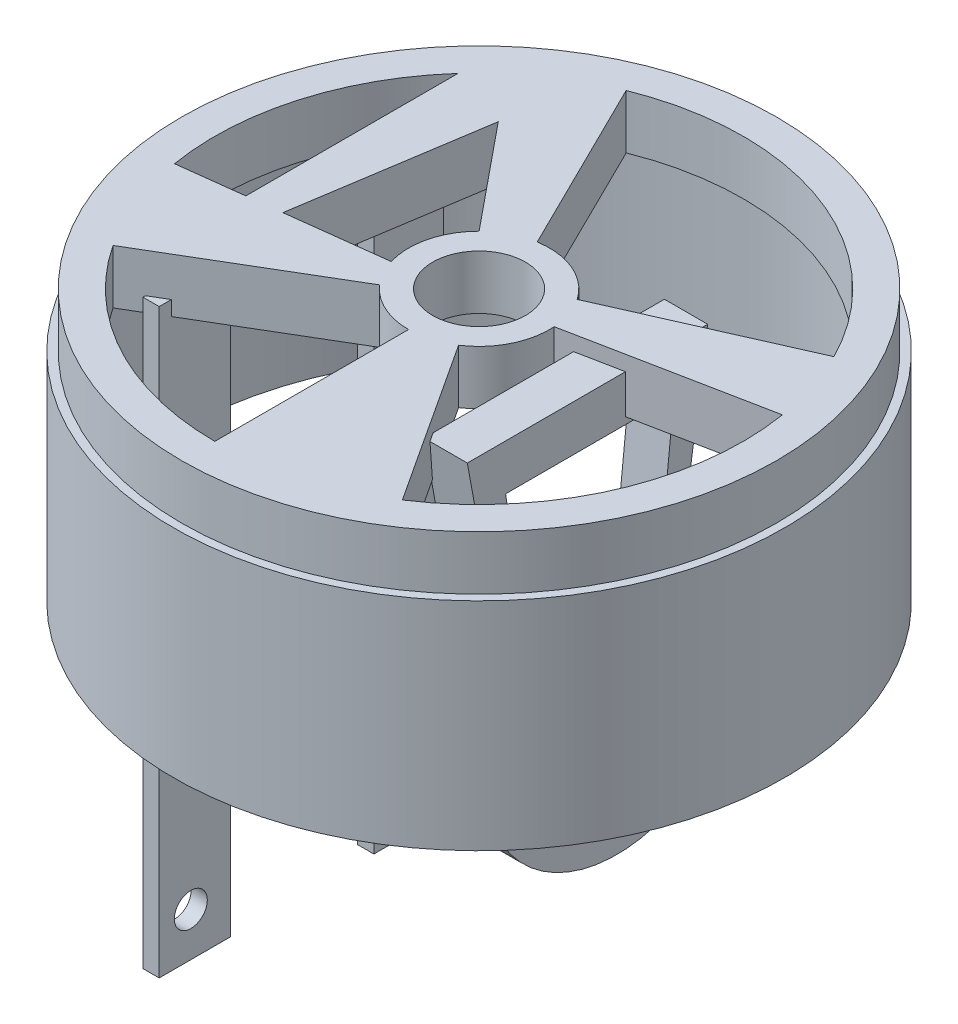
ISO-10303-21;
HEADER;
FILE_DESCRIPTION(('STEP AP214'),'2;1');
FILE_NAME('part.step','',(''),(''),'','','');
FILE_SCHEMA(('AUTOMOTIVE_DESIGN { 1 0 10303 214 1 1 1 1 }'));
ENDSEC;
DATA;
#1=APPLICATION_CONTEXT('core data for automotive mechanical design processes');
#2=APPLICATION_PROTOCOL_DEFINITION('international standard','automotive_design',2000,#1);
#3=PRODUCT_CONTEXT('',#1,'mechanical');
#4=PRODUCT('Part','Part','',(#3));
#5=PRODUCT_RELATED_PRODUCT_CATEGORY('part','',(#4));
#6=PRODUCT_DEFINITION_FORMATION('','',#4);
#7=PRODUCT_DEFINITION_CONTEXT('part definition',#1,'design');
#8=PRODUCT_DEFINITION('design','',#6,#7);
#9=PRODUCT_DEFINITION_SHAPE('','',#8);
#10=(LENGTH_UNIT() NAMED_UNIT(*) SI_UNIT(.MILLI.,.METRE.));
#11=(NAMED_UNIT(*) PLANE_ANGLE_UNIT() SI_UNIT($,.RADIAN.));
#12=(NAMED_UNIT(*) SI_UNIT($,.STERADIAN.) SOLID_ANGLE_UNIT());
#13=UNCERTAINTY_MEASURE_WITH_UNIT(LENGTH_MEASURE(1.E-05),#10,'distance_accuracy_value','');
#14=(GEOMETRIC_REPRESENTATION_CONTEXT(3) GLOBAL_UNCERTAINTY_ASSIGNED_CONTEXT((#13)) GLOBAL_UNIT_ASSIGNED_CONTEXT((#10,
#11,#12)) REPRESENTATION_CONTEXT('',''));
#15=CARTESIAN_POINT('',(0.,0.,0.));
#16=DIRECTION('',(0.,0.,1.));
#17=DIRECTION('',(1.,0.,0.));
#18=AXIS2_PLACEMENT_3D('',#15,#16,#17);
#19=CARTESIAN_POINT('',(0.,0.,0.));
#20=DIRECTION('',(0.,-1.,0.));
#21=DIRECTION('',(0.,0.,-1.));
#22=AXIS2_PLACEMENT_3D('',#19,#20,#21);
#23=PLANE('',#22);
#24=CARTESIAN_POINT('',(0.,0.,0.));
#25=DIRECTION('',(0.,-1.,0.));
#26=DIRECTION('',(0.,0.,-1.));
#27=AXIS2_PLACEMENT_3D('',#24,#25,#26);
#28=CIRCLE('',#27,56.5);
#29=CARTESIAN_POINT('',(0.,0.,-56.5));
#30=VERTEX_POINT('',#29);
#31=EDGE_CURVE('E49',#30,#30,#28,.T.);
#32=ORIENTED_EDGE('',*,*,#31,.F.);
#33=EDGE_LOOP('',(#32));
#34=FACE_BOUND('',#33,.T.);
#35=CARTESIAN_POINT('',(0.,0.,0.));
#36=DIRECTION('',(0.,-1.,0.));
#37=DIRECTION('',(0.,0.,-1.));
#38=AXIS2_PLACEMENT_3D('',#35,#36,#37);
#39=CIRCLE('',#38,55.);
#40=CARTESIAN_POINT('',(0.,0.,-55.));
#41=VERTEX_POINT('',#40);
#42=EDGE_CURVE('E60',#41,#41,#39,.T.);
#43=ORIENTED_EDGE('',*,*,#42,.T.);
#44=EDGE_LOOP('',(#43));
#45=FACE_BOUND('',#44,.T.);
#46=ADVANCED_FACE('F45',(#34,#45),#23,.F.);
#47=CARTESIAN_POINT('',(0.,-40.,0.));
#48=DIRECTION('',(0.,-1.,0.));
#49=DIRECTION('',(0.,0.,-1.));
#50=AXIS2_PLACEMENT_3D('',#47,#48,#49);
#51=PLANE('',#50);
#52=CARTESIAN_POINT('',(0.,-40.,0.));
#53=DIRECTION('',(0.,-1.,0.));
#54=DIRECTION('',(0.,0.,-1.));
#55=AXIS2_PLACEMENT_3D('',#52,#53,#54);
#56=CIRCLE('',#55,55.);
#57=CARTESIAN_POINT('',(0.,-40.,-55.));
#58=VERTEX_POINT('',#57);
#59=EDGE_CURVE('E56',#58,#58,#56,.T.);
#60=ORIENTED_EDGE('',*,*,#59,.F.);
#61=EDGE_LOOP('',(#60));
#62=FACE_BOUND('',#61,.T.);
#63=CARTESIAN_POINT('',(0.,-40.,0.));
#64=DIRECTION('',(0.,-1.,0.));
#65=DIRECTION('',(0.,0.,-1.));
#66=AXIS2_PLACEMENT_3D('',#63,#64,#65);
#67=CIRCLE('',#66,56.5);
#68=CARTESIAN_POINT('',(0.,-40.,-56.5));
#69=VERTEX_POINT('',#68);
#70=EDGE_CURVE('E12',#69,#69,#67,.T.);
#71=ORIENTED_EDGE('',*,*,#70,.T.);
#72=EDGE_LOOP('',(#71));
#73=FACE_BOUND('',#72,.T.);
#74=ADVANCED_FACE('F72',(#62,#73),#51,.T.);
#75=CARTESIAN_POINT('',(0.,0.,0.));
#76=DIRECTION('',(0.,-1.,0.));
#77=DIRECTION('',(0.,0.,-1.));
#78=AXIS2_PLACEMENT_3D('',#75,#76,#77);
#79=CYLINDRICAL_SURFACE('',#78,56.5);
#80=ORIENTED_EDGE('',*,*,#70,.F.);
#81=EDGE_LOOP('',(#80));
#82=FACE_BOUND('',#81,.T.);
#83=ORIENTED_EDGE('',*,*,#31,.T.);
#84=EDGE_LOOP('',(#83));
#85=FACE_BOUND('',#84,.T.);
#86=ADVANCED_FACE('F47',(#82,#85),#79,.T.);
#87=CARTESIAN_POINT('',(0.,0.,0.));
#88=DIRECTION('',(0.,-1.,0.));
#89=DIRECTION('',(0.,0.,-1.));
#90=AXIS2_PLACEMENT_3D('',#87,#88,#89);
#91=CYLINDRICAL_SURFACE('',#90,55.);
#92=ORIENTED_EDGE('',*,*,#59,.T.);
#93=EDGE_LOOP('',(#92));
#94=FACE_BOUND('',#93,.T.);
#95=ORIENTED_EDGE('',*,*,#42,.F.);
#96=EDGE_LOOP('',(#95));
#97=FACE_BOUND('',#96,.T.);
#98=ADVANCED_FACE('F65',(#94,#97),#91,.F.);
#99=CLOSED_SHELL('',(#46,#74,#86,#98));
#100=MANIFOLD_SOLID_BREP('B2',#99);
#101=CARTESIAN_POINT('',(0.,0.,0.));
#102=DIRECTION('',(0.,1.,0.));
#103=DIRECTION('',(0.,0.,1.));
#104=AXIS2_PLACEMENT_3D('',#101,#102,#103);
#105=PLANE('',#104);
#106=DIRECTION('',(-1.,0.,0.));
#107=VECTOR('',#106,1.);
#108=CARTESIAN_POINT('',(0.,0.,11.962392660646));
#109=LINE('',#108,#107);
#110=CARTESIAN_POINT('',(-34.,0.,11.962392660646));
#111=VERTEX_POINT('',#110);
#112=CARTESIAN_POINT('',(-37.,0.,11.962392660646));
#113=VERTEX_POINT('',#112);
#114=EDGE_CURVE('E793',#111,#113,#109,.T.);
#115=ORIENTED_EDGE('',*,*,#114,.T.);
#116=DIRECTION('',(0.,0.,1.));
#117=VECTOR('',#116,1.);
#118=CARTESIAN_POINT('',(-37.,0.,0.));
#119=LINE('',#118,#117);
#120=CARTESIAN_POINT('',(-37.,0.,24.6538675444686));
#121=VERTEX_POINT('',#120);
#122=EDGE_CURVE('E616',#113,#121,#119,.T.);
#123=ORIENTED_EDGE('',*,*,#122,.T.);
#124=DIRECTION('',(-0.860497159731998,0.,0.509455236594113));
#125=VECTOR('',#124,1.);
#126=CARTESIAN_POINT('',(-9.83134731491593,0.,8.56873324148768));
#127=LINE('',#126,#125);
#128=CARTESIAN_POINT('',(-40.7722128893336,0.,26.8871969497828));
#129=VERTEX_POINT('',#128);
#130=EDGE_CURVE('E622',#121,#129,#127,.T.);
#131=ORIENTED_EDGE('',*,*,#130,.T.);
#132=CARTESIAN_POINT('',(0.,0.,0.));
#133=DIRECTION('',(0.,1.,0.));
#134=DIRECTION('',(0.,0.,1.));
#135=AXIS2_PLACEMENT_3D('',#132,#133,#134);
#136=CIRCLE('',#135,48.839478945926);
#137=CARTESIAN_POINT('',(0.,0.,48.839478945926));
#138=VERTEX_POINT('',#137);
#139=EDGE_CURVE('E627',#129,#138,#136,.T.);
#140=ORIENTED_EDGE('',*,*,#139,.T.);
#141=DIRECTION('',(0.,0.,-1.));
#142=VECTOR('',#141,1.);
#143=CARTESIAN_POINT('',(0.,0.,13.0414178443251));
#144=LINE('',#143,#142);
#145=CARTESIAN_POINT('',(0.,0.,13.0414178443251));
#146=VERTEX_POINT('',#145);
#147=EDGE_CURVE('E630',#138,#146,#144,.T.);
#148=ORIENTED_EDGE('',*,*,#147,.T.);
#149=CARTESIAN_POINT('',(0.,0.,0.));
#150=DIRECTION('',(0.,-1.,0.));
#151=DIRECTION('',(0.,0.,1.));
#152=AXIS2_PLACEMENT_3D('',#149,#150,#151);
#153=CIRCLE('',#152,13.0414178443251);
#154=CARTESIAN_POINT('',(-9.83134731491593,0.,8.56873324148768));
#155=VERTEX_POINT('',#154);
#156=EDGE_CURVE('E619',#146,#155,#153,.T.);
#157=ORIENTED_EDGE('',*,*,#156,.T.);
#158=CARTESIAN_POINT('',(-34.,0.,22.8777248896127));
#159=VERTEX_POINT('',#158);
#160=EDGE_CURVE('E624',#155,#159,#127,.T.);
#161=ORIENTED_EDGE('',*,*,#160,.T.);
#162=DIRECTION('',(0.,0.,1.));
#163=VECTOR('',#162,1.);
#164=CARTESIAN_POINT('',(-34.,0.,0.));
#165=LINE('',#164,#163);
#166=EDGE_CURVE('E610',#111,#159,#165,.T.);
#167=ORIENTED_EDGE('',*,*,#166,.F.);
#168=EDGE_LOOP('',(#115,#123,#131,#140,#148,#157,#161,#167));
#169=FACE_BOUND('',#168,.T.);
#170=DIRECTION('',(0.992580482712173,0.,-0.121589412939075));
#171=VECTOR('',#170,1.);
#172=CARTESIAN_POINT('',(-12.4894655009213,0.,3.75390874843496));
#173=LINE('',#172,#171);
#174=CARTESIAN_POINT('',(-30.3243159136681,0.,5.93864744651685));
#175=VERTEX_POINT('',#174);
#176=CARTESIAN_POINT('',(-12.4894655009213,0.,3.75390874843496));
#177=VERTEX_POINT('',#176);
#178=EDGE_CURVE('E720',#175,#177,#173,.T.);
#179=ORIENTED_EDGE('',*,*,#178,.T.);
#180=CARTESIAN_POINT('',(0.,0.,0.));
#181=DIRECTION('',(0.,-1.,0.));
#182=DIRECTION('',(0.,0.,1.));
#183=AXIS2_PLACEMENT_3D('',#180,#181,#182);
#184=CIRCLE('',#183,13.0414178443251);
#185=CARTESIAN_POINT('',(-9.21961973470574,0.,-9.22372979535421));
#186=VERTEX_POINT('',#185);
#187=EDGE_CURVE('E710',#177,#186,#184,.T.);
#188=ORIENTED_EDGE('',*,*,#187,.T.);
#189=DIRECTION('',(-0.632341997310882,0.,-0.774689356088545));
#190=VECTOR('',#189,1.);
#191=CARTESIAN_POINT('',(-24.9746170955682,0.,-28.5253558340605));
#192=LINE('',#191,#190);
#193=CARTESIAN_POINT('',(-24.9746170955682,0.,-28.5253558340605));
#194=VERTEX_POINT('',#193);
#195=EDGE_CURVE('E713',#186,#194,#192,.T.);
#196=ORIENTED_EDGE('',*,*,#195,.T.);
#197=DIRECTION('',(-0.153388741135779,0.,0.988165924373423));
#198=VECTOR('',#197,1.);
#199=CARTESIAN_POINT('',(-30.3243159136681,0.,5.93864744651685));
#200=LINE('',#199,#198);
#201=EDGE_CURVE('E717',#194,#175,#200,.T.);
#202=ORIENTED_EDGE('',*,*,#201,.T.);
#203=EDGE_LOOP('',(#179,#188,#196,#202));
#204=FACE_BOUND('',#203,.T.);
#205=CARTESIAN_POINT('',(0.,0.,0.));
#206=DIRECTION('',(0.,1.,0.));
#207=DIRECTION('',(0.,0.,1.));
#208=AXIS2_PLACEMENT_3D('',#205,#206,#207);
#209=CIRCLE('',#208,8.56873324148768);
#210=CARTESIAN_POINT('',(0.,0.,8.56873324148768));
#211=VERTEX_POINT('',#210);
#212=EDGE_CURVE('E775',#211,#211,#209,.T.);
#213=ORIENTED_EDGE('',*,*,#212,.T.);
#214=EDGE_LOOP('',(#213));
#215=FACE_BOUND('',#214,.T.);
#216=CARTESIAN_POINT('',(0.,0.,0.));
#217=DIRECTION('',(0.,1.,0.));
#218=DIRECTION('',(0.,0.,1.));
#219=AXIS2_PLACEMENT_3D('',#216,#217,#218);
#220=CIRCLE('',#219,55.);
#221=CARTESIAN_POINT('',(0.,0.,55.));
#222=VERTEX_POINT('',#221);
#223=EDGE_CURVE('E778',#222,#222,#220,.T.);
#224=ORIENTED_EDGE('',*,*,#223,.F.);
#225=EDGE_LOOP('',(#224));
#226=FACE_BOUND('',#225,.T.);
#227=DIRECTION('',(0.,0.,-1.));
#228=VECTOR('',#227,1.);
#229=CARTESIAN_POINT('',(-36.4230760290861,0.,6.6857351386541));
#230=LINE('',#229,#228);
#231=CARTESIAN_POINT('',(-36.4230760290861,0.,6.6857351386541));
#232=VERTEX_POINT('',#231);
#233=CARTESIAN_POINT('',(-36.4230760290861,0.,-14.5563477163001));
#234=VERTEX_POINT('',#233);
#235=EDGE_CURVE('E693',#232,#234,#230,.T.);
#236=ORIENTED_EDGE('',*,*,#235,.T.);
#237=DIRECTION('',(1.,0.,0.));
#238=VECTOR('',#237,1.);
#239=CARTESIAN_POINT('',(0.,0.,-14.5563477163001));
#240=LINE('',#239,#238);
#241=CARTESIAN_POINT('',(-34.,0.,-14.5563477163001));
#242=VERTEX_POINT('',#241);
#243=EDGE_CURVE('E569',#234,#242,#240,.T.);
#244=ORIENTED_EDGE('',*,*,#243,.T.);
#245=DIRECTION('',(0.,0.,1.));
#246=VECTOR('',#245,1.);
#247=CARTESIAN_POINT('',(-34.,0.,0.));
#248=LINE('',#247,#246);
#249=CARTESIAN_POINT('',(-34.,0.,-27.4702322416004));
#250=VERTEX_POINT('',#249);
#251=EDGE_CURVE('E804',#250,#242,#248,.T.);
#252=ORIENTED_EDGE('',*,*,#251,.F.);
#253=DIRECTION('',(-1.,0.,0.));
#254=VECTOR('',#253,1.);
#255=CARTESIAN_POINT('',(0.,0.,-27.4702322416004));
#256=LINE('',#255,#254);
#257=CARTESIAN_POINT('',(-36.4230760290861,0.,-27.4702322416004));
#258=VERTEX_POINT('',#257);
#259=EDGE_CURVE('E560',#250,#258,#256,.T.);
#260=ORIENTED_EDGE('',*,*,#259,.T.);
#261=CARTESIAN_POINT('',(-36.4230760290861,0.,-32.536967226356));
#262=VERTEX_POINT('',#261);
#263=EDGE_CURVE('E692',#258,#262,#230,.T.);
#264=ORIENTED_EDGE('',*,*,#263,.T.);
#265=CARTESIAN_POINT('',(0.,0.,0.));
#266=DIRECTION('',(0.,1.,0.));
#267=DIRECTION('',(0.,0.,1.));
#268=AXIS2_PLACEMENT_3D('',#265,#266,#267);
#269=CIRCLE('',#268,48.839478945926);
#270=CARTESIAN_POINT('',(-48.1591663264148,0.,8.12338614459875));
#271=VERTEX_POINT('',#270);
#272=EDGE_CURVE('E685',#262,#271,#269,.T.);
#273=ORIENTED_EDGE('',*,*,#272,.T.);
#274=DIRECTION('',(0.992580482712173,0.,-0.121589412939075));
#275=VECTOR('',#274,1.);
#276=CARTESIAN_POINT('',(-36.4230760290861,0.,6.6857351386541));
#277=LINE('',#276,#275);
#278=EDGE_CURVE('E688',#271,#232,#277,.T.);
#279=ORIENTED_EDGE('',*,*,#278,.T.);
#280=EDGE_LOOP('',(#236,#244,#252,#260,#264,#273,#279));
#281=FACE_BOUND('',#280,.T.);
#282=DIRECTION('',(-0.98091292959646,0.,0.194447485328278));
#283=VECTOR('',#282,1.);
#284=CARTESIAN_POINT('',(48.2033721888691,0.,-7.85681954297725));
#285=LINE('',#284,#283);
#286=CARTESIAN_POINT('',(48.2033721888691,0.,-7.85681954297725));
#287=VERTEX_POINT('',#286);
#288=CARTESIAN_POINT('',(24.,0.,-3.05895755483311));
#289=VERTEX_POINT('',#288);
#290=EDGE_CURVE('E747',#287,#289,#285,.T.);
#291=ORIENTED_EDGE('',*,*,#290,.T.);
#292=DIRECTION('',(0.,0.,-1.));
#293=VECTOR('',#292,1.);
#294=CARTESIAN_POINT('',(24.,0.,0.));
#295=LINE('',#294,#293);
#296=CARTESIAN_POINT('',(24.,0.,-13.2309291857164));
#297=VERTEX_POINT('',#296);
#298=EDGE_CURVE('E518',#289,#297,#295,.T.);
#299=ORIENTED_EDGE('',*,*,#298,.T.);
#300=DIRECTION('',(0.91439784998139,0.,-0.404816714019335));
#301=VECTOR('',#300,1.);
#302=CARTESIAN_POINT('',(43.6409653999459,0.,-21.9262592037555));
#303=LINE('',#302,#301);
#304=CARTESIAN_POINT('',(43.6409653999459,0.,-21.9262592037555));
#305=VERTEX_POINT('',#304);
#306=EDGE_CURVE('E662',#297,#305,#303,.T.);
#307=ORIENTED_EDGE('',*,*,#306,.T.);
#308=CARTESIAN_POINT('',(0.,0.,0.));
#309=DIRECTION('',(0.,1.,0.));
#310=DIRECTION('',(0.,0.,1.));
#311=AXIS2_PLACEMENT_3D('',#308,#309,#310);
#312=CIRCLE('',#311,48.839478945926);
#313=CARTESIAN_POINT('',(-18.1538595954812,0.,-45.3401817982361));
#314=VERTEX_POINT('',#313);
#315=EDGE_CURVE('E652',#305,#314,#312,.T.);
#316=ORIENTED_EDGE('',*,*,#315,.T.);
#317=DIRECTION('',(0.442684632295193,0.,0.896677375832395));
#318=VECTOR('',#317,1.);
#319=CARTESIAN_POINT('',(-2.12231204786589,0.,-12.8675705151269));
#320=LINE('',#319,#318);
#321=CARTESIAN_POINT('',(-2.12231204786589,0.,-12.8675705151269));
#322=VERTEX_POINT('',#321);
#323=EDGE_CURVE('E655',#314,#322,#320,.T.);
#324=ORIENTED_EDGE('',*,*,#323,.T.);
#325=CARTESIAN_POINT('',(0.,0.,0.));
#326=DIRECTION('',(0.,-1.,0.));
#327=DIRECTION('',(0.,0.,1.));
#328=AXIS2_PLACEMENT_3D('',#325,#326,#327);
#329=CIRCLE('',#328,13.0414178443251);
#330=CARTESIAN_POINT('',(10.759749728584,0.,-7.36928525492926));
#331=VERTEX_POINT('',#330);
#332=EDGE_CURVE('E659',#322,#331,#329,.T.);
#333=ORIENTED_EDGE('',*,*,#332,.T.);
#334=CARTESIAN_POINT('',(16.,0.,-9.68921732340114));
#335=VERTEX_POINT('',#334);
#336=EDGE_CURVE('E663',#331,#335,#303,.T.);
#337=ORIENTED_EDGE('',*,*,#336,.T.);
#338=DIRECTION('',(0.,0.,-1.));
#339=VECTOR('',#338,1.);
#340=CARTESIAN_POINT('',(16.,0.,0.));
#341=LINE('',#340,#339);
#342=CARTESIAN_POINT('',(16.,0.,-1.47310845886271));
#343=VERTEX_POINT('',#342);
#344=EDGE_CURVE('E510',#343,#335,#341,.T.);
#345=ORIENTED_EDGE('',*,*,#344,.F.);
#346=CARTESIAN_POINT('',(13.011644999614,0.,-0.880723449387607));
#347=VERTEX_POINT('',#346);
#348=EDGE_CURVE('E745',#343,#347,#285,.T.);
#349=ORIENTED_EDGE('',*,*,#348,.T.);
#350=CARTESIAN_POINT('',(0.,0.,0.));
#351=DIRECTION('',(0.,-1.,0.));
#352=DIRECTION('',(0.,0.,1.));
#353=AXIS2_PLACEMENT_3D('',#350,#351,#352);
#354=CIRCLE('',#353,13.0414178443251);
#355=CARTESIAN_POINT('',(7.13231048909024,0.,10.9182748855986));
#356=VERTEX_POINT('',#355);
#357=EDGE_CURVE('E750',#347,#356,#354,.T.);
#358=ORIENTED_EDGE('',*,*,#357,.T.);
#359=DIRECTION('',(0.546896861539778,0.,0.837199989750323));
#360=VECTOR('',#359,1.);
#361=CARTESIAN_POINT('',(26.710157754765,0.,40.8884112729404));
#362=LINE('',#361,#360);
#363=CARTESIAN_POINT('',(16.,0.,24.4931005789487));
#364=VERTEX_POINT('',#363);
#365=EDGE_CURVE('E754',#356,#364,#362,.T.);
#366=ORIENTED_EDGE('',*,*,#365,.T.);
#367=CARTESIAN_POINT('',(16.,0.,24.8516827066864));
#368=VERTEX_POINT('',#367);
#369=EDGE_CURVE('E122',#368,#364,#341,.T.);
#370=ORIENTED_EDGE('',*,*,#369,.F.);
#371=DIRECTION('',(-1.,0.,0.));
#372=VECTOR('',#371,1.);
#373=CARTESIAN_POINT('',(0.,0.,24.8516827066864));
#374=LINE('',#373,#372);
#375=CARTESIAN_POINT('',(16.2342420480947,0.,24.8516827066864));
#376=VERTEX_POINT('',#375);
#377=EDGE_CURVE('E522',#376,#368,#374,.T.);
#378=ORIENTED_EDGE('',*,*,#377,.F.);
#379=CARTESIAN_POINT('',(26.710157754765,0.,40.8884112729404));
#380=VERTEX_POINT('',#379);
#381=EDGE_CURVE('E753',#376,#380,#362,.T.);
#382=ORIENTED_EDGE('',*,*,#381,.T.);
#383=CARTESIAN_POINT('',(0.,0.,0.));
#384=DIRECTION('',(0.,1.,0.));
#385=DIRECTION('',(0.,0.,1.));
#386=AXIS2_PLACEMENT_3D('',#383,#384,#385);
#387=CIRCLE('',#386,48.839478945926);
#388=EDGE_CURVE('E742',#380,#287,#387,.T.);
#389=ORIENTED_EDGE('',*,*,#388,.T.);
#390=EDGE_LOOP('',(#291,#299,#307,#316,#324,#333,#337,#345,#349,#358,#366,#370,#378,#382,#389));
#391=FACE_BOUND('',#390,.T.);
#392=ADVANCED_FACE('F107',(#169,#204,#215,#226,#281,#391),#105,.F.);
#393=CARTESIAN_POINT('',(26.710157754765,0.,40.8884112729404));
#394=DIRECTION('',(-0.837199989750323,0.,0.546896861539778));
#395=DIRECTION('',(0.546896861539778,0.,0.837199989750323));
#396=AXIS2_PLACEMENT_3D('',#393,#394,#395);
#397=PLANE('',#396);
#398=DIRECTION('',(0.,1.,0.));
#399=VECTOR('',#398,1.);
#400=CARTESIAN_POINT('',(16.,0.,24.4931005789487));
#401=LINE('',#400,#399);
#402=CARTESIAN_POINT('',(16.,7.2033194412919,24.4931005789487));
#403=VERTEX_POINT('',#402);
#404=EDGE_CURVE('E516',#364,#403,#401,.T.);
#405=ORIENTED_EDGE('',*,*,#404,.F.);
#406=ORIENTED_EDGE('',*,*,#365,.F.);
#407=DIRECTION('',(0.,1.,0.));
#408=VECTOR('',#407,1.);
#409=CARTESIAN_POINT('',(7.13231048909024,0.,10.9182748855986));
#410=LINE('',#409,#408);
#411=CARTESIAN_POINT('',(7.13231048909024,10.,10.9182748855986));
#412=VERTEX_POINT('',#411);
#413=EDGE_CURVE('E769',#356,#412,#410,.T.);
#414=ORIENTED_EDGE('',*,*,#413,.T.);
#415=DIRECTION('',(0.546896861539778,0.,0.837199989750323));
#416=VECTOR('',#415,1.);
#417=CARTESIAN_POINT('',(26.710157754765,10.,40.8884112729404));
#418=LINE('',#417,#416);
#419=CARTESIAN_POINT('',(26.710157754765,10.,40.8884112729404));
#420=VERTEX_POINT('',#419);
#421=EDGE_CURVE('E746',#412,#420,#418,.T.);
#422=ORIENTED_EDGE('',*,*,#421,.T.);
#423=DIRECTION('',(0.,1.,0.));
#424=VECTOR('',#423,1.);
#425=CARTESIAN_POINT('',(26.710157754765,0.,40.8884112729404));
#426=LINE('',#425,#424);
#427=EDGE_CURVE('E766',#380,#420,#426,.T.);
#428=ORIENTED_EDGE('',*,*,#427,.F.);
#429=ORIENTED_EDGE('',*,*,#381,.F.);
#430=DIRECTION('',(-0.117133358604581,-0.976794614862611,-0.179309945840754));
#431=VECTOR('',#430,1.);
#432=CARTESIAN_POINT('',(16.7147961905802,4.00742114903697,25.5873240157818));
#433=LINE('',#432,#431);
#434=CARTESIAN_POINT('',(17.0980357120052,7.2033194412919,26.1739942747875));
#435=VERTEX_POINT('',#434);
#436=EDGE_CURVE('E43',#435,#376,#433,.T.);
#437=ORIENTED_EDGE('',*,*,#436,.F.);
#438=DIRECTION('',(0.546896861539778,0.,0.837199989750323));
#439=VECTOR('',#438,1.);
#440=CARTESIAN_POINT('',(26.710157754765,7.2033194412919,40.8884112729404));
#441=LINE('',#440,#439);
#442=EDGE_CURVE('E130',#403,#435,#441,.T.);
#443=ORIENTED_EDGE('',*,*,#442,.F.);
#444=EDGE_LOOP('',(#405,#406,#414,#422,#428,#429,#437,#443));
#445=FACE_BOUND('',#444,.T.);
#446=ADVANCED_FACE('F865',(#445),#397,.F.);
#447=CARTESIAN_POINT('',(0.,10.,0.));
#448=DIRECTION('',(0.,1.,0.));
#449=DIRECTION('',(0.,0.,1.));
#450=AXIS2_PLACEMENT_3D('',#447,#448,#449);
#451=PLANE('',#450);
#452=CARTESIAN_POINT('',(0.,10.,0.));
#453=DIRECTION('',(0.,1.,0.));
#454=DIRECTION('',(0.,0.,1.));
#455=AXIS2_PLACEMENT_3D('',#452,#453,#454);
#456=CIRCLE('',#455,55.);
#457=CARTESIAN_POINT('',(0.,10.,55.));
#458=VERTEX_POINT('',#457);
#459=EDGE_CURVE('E781',#458,#458,#456,.T.);
#460=ORIENTED_EDGE('',*,*,#459,.T.);
#461=EDGE_LOOP('',(#460));
#462=FACE_BOUND('',#461,.T.);
#463=CARTESIAN_POINT('',(0.,10.,0.));
#464=DIRECTION('',(0.,1.,0.));
#465=DIRECTION('',(0.,0.,1.));
#466=AXIS2_PLACEMENT_3D('',#463,#464,#465);
#467=CIRCLE('',#466,8.56873324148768);
#468=CARTESIAN_POINT('',(0.,10.,8.56873324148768));
#469=VERTEX_POINT('',#468);
#470=EDGE_CURVE('E768',#469,#469,#467,.T.);
#471=ORIENTED_EDGE('',*,*,#470,.F.);
#472=EDGE_LOOP('',(#471));
#473=FACE_BOUND('',#472,.T.);
#474=CARTESIAN_POINT('',(0.,10.,0.));
#475=DIRECTION('',(0.,1.,0.));
#476=DIRECTION('',(0.,0.,1.));
#477=AXIS2_PLACEMENT_3D('',#474,#475,#476);
#478=CIRCLE('',#477,48.839478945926);
#479=CARTESIAN_POINT('',(48.2033721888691,10.,-7.85681954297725));
#480=VERTEX_POINT('',#479);
#481=EDGE_CURVE('E735',#420,#480,#478,.T.);
#482=ORIENTED_EDGE('',*,*,#481,.F.);
#483=ORIENTED_EDGE('',*,*,#421,.F.);
#484=CARTESIAN_POINT('',(0.,10.,0.));
#485=DIRECTION('',(0.,-1.,0.));
#486=DIRECTION('',(0.,0.,1.));
#487=AXIS2_PLACEMENT_3D('',#484,#485,#486);
#488=CIRCLE('',#487,13.0414178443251);
#489=CARTESIAN_POINT('',(13.011644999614,10.,-0.880723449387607));
#490=VERTEX_POINT('',#489);
#491=EDGE_CURVE('E761',#490,#412,#488,.T.);
#492=ORIENTED_EDGE('',*,*,#491,.F.);
#493=DIRECTION('',(-0.98091292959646,0.,0.194447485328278));
#494=VECTOR('',#493,1.);
#495=CARTESIAN_POINT('',(48.2033721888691,10.,-7.85681954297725));
#496=LINE('',#495,#494);
#497=EDGE_CURVE('E758',#480,#490,#496,.T.);
#498=ORIENTED_EDGE('',*,*,#497,.F.);
#499=EDGE_LOOP('',(#482,#483,#492,#498));
#500=FACE_BOUND('',#499,.T.);
#501=CARTESIAN_POINT('',(0.,10.,0.));
#502=DIRECTION('',(0.,-1.,0.));
#503=DIRECTION('',(0.,0.,1.));
#504=AXIS2_PLACEMENT_3D('',#501,#502,#503);
#505=CIRCLE('',#504,13.0414178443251);
#506=CARTESIAN_POINT('',(-12.4894655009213,10.,3.75390874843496));
#507=VERTEX_POINT('',#506);
#508=CARTESIAN_POINT('',(-9.21961973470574,10.,-9.22372979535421));
#509=VERTEX_POINT('',#508);
#510=EDGE_CURVE('E705',#507,#509,#505,.T.);
#511=ORIENTED_EDGE('',*,*,#510,.F.);
#512=DIRECTION('',(0.992580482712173,0.,-0.121589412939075));
#513=VECTOR('',#512,1.);
#514=CARTESIAN_POINT('',(-12.4894655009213,10.,3.75390874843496));
#515=LINE('',#514,#513);
#516=CARTESIAN_POINT('',(-30.3243159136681,10.,5.93864744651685));
#517=VERTEX_POINT('',#516);
#518=EDGE_CURVE('E714',#517,#507,#515,.T.);
#519=ORIENTED_EDGE('',*,*,#518,.F.);
#520=DIRECTION('',(-0.153388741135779,0.,0.988165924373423));
#521=VECTOR('',#520,1.);
#522=CARTESIAN_POINT('',(-30.3243159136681,10.,5.93864744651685));
#523=LINE('',#522,#521);
#524=CARTESIAN_POINT('',(-24.9746170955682,10.,-28.5253558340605));
#525=VERTEX_POINT('',#524);
#526=EDGE_CURVE('E728',#525,#517,#523,.T.);
#527=ORIENTED_EDGE('',*,*,#526,.F.);
#528=DIRECTION('',(-0.632341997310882,0.,-0.774689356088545));
#529=VECTOR('',#528,1.);
#530=CARTESIAN_POINT('',(-24.9746170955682,10.,-28.5253558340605));
#531=LINE('',#530,#529);
#532=EDGE_CURVE('E725',#509,#525,#531,.T.);
#533=ORIENTED_EDGE('',*,*,#532,.F.);
#534=EDGE_LOOP('',(#511,#519,#527,#533));
#535=FACE_BOUND('',#534,.T.);
#536=CARTESIAN_POINT('',(0.,10.,0.));
#537=DIRECTION('',(0.,1.,0.));
#538=DIRECTION('',(0.,0.,1.));
#539=AXIS2_PLACEMENT_3D('',#536,#537,#538);
#540=CIRCLE('',#539,48.839478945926);
#541=CARTESIAN_POINT('',(-36.4230760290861,10.,-32.536967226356));
#542=VERTEX_POINT('',#541);
#543=CARTESIAN_POINT('',(-48.1591663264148,10.,8.12338614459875));
#544=VERTEX_POINT('',#543);
#545=EDGE_CURVE('E678',#542,#544,#540,.T.);
#546=ORIENTED_EDGE('',*,*,#545,.F.);
#547=DIRECTION('',(0.,0.,-1.));
#548=VECTOR('',#547,1.);
#549=CARTESIAN_POINT('',(-36.4230760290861,10.,6.6857351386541));
#550=LINE('',#549,#548);
#551=CARTESIAN_POINT('',(-36.4230760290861,10.,6.6857351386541));
#552=VERTEX_POINT('',#551);
#553=EDGE_CURVE('E689',#552,#542,#550,.T.);
#554=ORIENTED_EDGE('',*,*,#553,.F.);
#555=DIRECTION('',(0.992580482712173,0.,-0.121589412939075));
#556=VECTOR('',#555,1.);
#557=CARTESIAN_POINT('',(-36.4230760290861,10.,6.6857351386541));
#558=LINE('',#557,#556);
#559=EDGE_CURVE('E698',#544,#552,#558,.T.);
#560=ORIENTED_EDGE('',*,*,#559,.F.);
#561=EDGE_LOOP('',(#546,#554,#560));
#562=FACE_BOUND('',#561,.T.);
#563=CARTESIAN_POINT('',(0.,10.,0.));
#564=DIRECTION('',(0.,1.,0.));
#565=DIRECTION('',(0.,0.,1.));
#566=AXIS2_PLACEMENT_3D('',#563,#564,#565);
#567=CIRCLE('',#566,48.839478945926);
#568=CARTESIAN_POINT('',(43.6409653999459,10.,-21.9262592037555));
#569=VERTEX_POINT('',#568);
#570=CARTESIAN_POINT('',(-18.1538595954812,10.,-45.3401817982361));
#571=VERTEX_POINT('',#570);
#572=EDGE_CURVE('E645',#569,#571,#567,.T.);
#573=ORIENTED_EDGE('',*,*,#572,.F.);
#574=DIRECTION('',(0.91439784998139,0.,-0.404816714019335));
#575=VECTOR('',#574,1.);
#576=CARTESIAN_POINT('',(43.6409653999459,10.,-21.9262592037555));
#577=LINE('',#576,#575);
#578=CARTESIAN_POINT('',(10.759749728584,10.,-7.36928525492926));
#579=VERTEX_POINT('',#578);
#580=EDGE_CURVE('E656',#579,#569,#577,.T.);
#581=ORIENTED_EDGE('',*,*,#580,.F.);
#582=CARTESIAN_POINT('',(0.,10.,0.));
#583=DIRECTION('',(0.,-1.,0.));
#584=DIRECTION('',(0.,0.,1.));
#585=AXIS2_PLACEMENT_3D('',#582,#583,#584);
#586=CIRCLE('',#585,13.0414178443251);
#587=CARTESIAN_POINT('',(-2.12231204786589,10.,-12.8675705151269));
#588=VERTEX_POINT('',#587);
#589=EDGE_CURVE('E671',#588,#579,#586,.T.);
#590=ORIENTED_EDGE('',*,*,#589,.F.);
#591=DIRECTION('',(0.442684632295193,0.,0.896677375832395));
#592=VECTOR('',#591,1.);
#593=CARTESIAN_POINT('',(-2.12231204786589,10.,-12.8675705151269));
#594=LINE('',#593,#592);
#595=EDGE_CURVE('E668',#571,#588,#594,.T.);
#596=ORIENTED_EDGE('',*,*,#595,.F.);
#597=EDGE_LOOP('',(#573,#581,#590,#596));
#598=FACE_BOUND('',#597,.T.);
#599=CARTESIAN_POINT('',(0.,10.,0.));
#600=DIRECTION('',(0.,-1.,0.));
#601=DIRECTION('',(0.,0.,1.));
#602=AXIS2_PLACEMENT_3D('',#599,#600,#601);
#603=CIRCLE('',#602,13.0414178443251);
#604=CARTESIAN_POINT('',(0.,10.,13.0414178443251));
#605=VERTEX_POINT('',#604);
#606=CARTESIAN_POINT('',(-9.83134731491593,10.,8.56873324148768));
#607=VERTEX_POINT('',#606);
#608=EDGE_CURVE('E618',#605,#607,#603,.T.);
#609=ORIENTED_EDGE('',*,*,#608,.F.);
#610=DIRECTION('',(0.,0.,-1.));
#611=VECTOR('',#610,1.);
#612=CARTESIAN_POINT('',(0.,10.,13.0414178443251));
#613=LINE('',#612,#611);
#614=CARTESIAN_POINT('',(0.,10.,48.839478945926));
#615=VERTEX_POINT('',#614);
#616=EDGE_CURVE('E623',#615,#605,#613,.T.);
#617=ORIENTED_EDGE('',*,*,#616,.F.);
#618=CARTESIAN_POINT('',(0.,10.,0.));
#619=DIRECTION('',(0.,1.,0.));
#620=DIRECTION('',(0.,0.,1.));
#621=AXIS2_PLACEMENT_3D('',#618,#619,#620);
#622=CIRCLE('',#621,48.839478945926);
#623=CARTESIAN_POINT('',(-40.7722128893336,10.,26.8871969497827));
#624=VERTEX_POINT('',#623);
#625=EDGE_CURVE('E638',#624,#615,#622,.T.);
#626=ORIENTED_EDGE('',*,*,#625,.F.);
#627=DIRECTION('',(-0.860497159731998,0.,0.509455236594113));
#628=VECTOR('',#627,1.);
#629=CARTESIAN_POINT('',(-9.83134731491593,10.,8.56873324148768));
#630=LINE('',#629,#628);
#631=EDGE_CURVE('E635',#607,#624,#630,.T.);
#632=ORIENTED_EDGE('',*,*,#631,.F.);
#633=EDGE_LOOP('',(#609,#617,#626,#632));
#634=FACE_BOUND('',#633,.T.);
#635=ADVANCED_FACE('F845',(#462,#473,#500,#535,#562,#598,#634),#451,.T.);
#636=CARTESIAN_POINT('',(0.,10.,0.));
#637=DIRECTION('',(0.,-1.,0.));
#638=DIRECTION('',(0.,0.,-1.));
#639=AXIS2_PLACEMENT_3D('',#636,#637,#638);
#640=CYLINDRICAL_SURFACE('',#639,55.);
#641=ORIENTED_EDGE('',*,*,#459,.F.);
#642=EDGE_LOOP('',(#641));
#643=FACE_BOUND('',#642,.T.);
#644=ORIENTED_EDGE('',*,*,#223,.T.);
#645=EDGE_LOOP('',(#644));
#646=FACE_BOUND('',#645,.T.);
#647=ADVANCED_FACE('F109',(#643,#646),#640,.T.);
#648=CARTESIAN_POINT('',(0.,0.,0.));
#649=DIRECTION('',(0.,1.,0.));
#650=DIRECTION('',(0.,0.,1.));
#651=AXIS2_PLACEMENT_3D('',#648,#649,#650);
#652=CYLINDRICAL_SURFACE('',#651,8.56873324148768);
#653=ORIENTED_EDGE('',*,*,#212,.F.);
#654=EDGE_LOOP('',(#653));
#655=FACE_BOUND('',#654,.T.);
#656=ORIENTED_EDGE('',*,*,#470,.T.);
#657=EDGE_LOOP('',(#656));
#658=FACE_BOUND('',#657,.T.);
#659=ADVANCED_FACE('F882',(#655,#658),#652,.F.);
#660=CARTESIAN_POINT('',(0.,0.,0.));
#661=DIRECTION('',(0.,1.,0.));
#662=DIRECTION('',(0.,0.,1.));
#663=AXIS2_PLACEMENT_3D('',#660,#661,#662);
#664=CYLINDRICAL_SURFACE('',#663,48.839478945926);
#665=ORIENTED_EDGE('',*,*,#481,.T.);
#666=DIRECTION('',(0.,1.,0.));
#667=VECTOR('',#666,1.);
#668=CARTESIAN_POINT('',(48.2033721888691,0.,-7.85681954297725));
#669=LINE('',#668,#667);
#670=EDGE_CURVE('E756',#287,#480,#669,.T.);
#671=ORIENTED_EDGE('',*,*,#670,.F.);
#672=ORIENTED_EDGE('',*,*,#388,.F.);
#673=ORIENTED_EDGE('',*,*,#427,.T.);
#674=EDGE_LOOP('',(#665,#671,#672,#673));
#675=FACE_BOUND('',#674,.T.);
#676=ADVANCED_FACE('F880',(#675),#664,.F.);
#677=CARTESIAN_POINT('',(0.,0.,0.));
#678=DIRECTION('',(0.,1.,0.));
#679=DIRECTION('',(0.,0.,1.));
#680=AXIS2_PLACEMENT_3D('',#677,#678,#679);
#681=CYLINDRICAL_SURFACE('',#680,13.0414178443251);
#682=ORIENTED_EDGE('',*,*,#491,.T.);
#683=ORIENTED_EDGE('',*,*,#413,.F.);
#684=ORIENTED_EDGE('',*,*,#357,.F.);
#685=DIRECTION('',(0.,1.,0.));
#686=VECTOR('',#685,1.);
#687=CARTESIAN_POINT('',(13.011644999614,0.,-0.880723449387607));
#688=LINE('',#687,#686);
#689=EDGE_CURVE('E771',#347,#490,#688,.T.);
#690=ORIENTED_EDGE('',*,*,#689,.T.);
#691=EDGE_LOOP('',(#682,#683,#684,#690));
#692=FACE_BOUND('',#691,.T.);
#693=ADVANCED_FACE('F869',(#692),#681,.T.);
#694=CARTESIAN_POINT('',(48.2033721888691,0.,-7.85681954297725));
#695=DIRECTION('',(-0.194447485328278,0.,-0.98091292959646));
#696=DIRECTION('',(-0.98091292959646,0.,0.194447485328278));
#697=AXIS2_PLACEMENT_3D('',#694,#695,#696);
#698=PLANE('',#697);
#699=DIRECTION('',(-0.98091292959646,0.,0.194447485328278));
#700=VECTOR('',#699,1.);
#701=CARTESIAN_POINT('',(48.2033721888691,7.2033194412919,-7.85681954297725));
#702=LINE('',#701,#700);
#703=CARTESIAN_POINT('',(24.,7.2033194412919,-3.05895755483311));
#704=VERTEX_POINT('',#703);
#705=CARTESIAN_POINT('',(16.,7.2033194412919,-1.47310845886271));
#706=VERTEX_POINT('',#705);
#707=EDGE_CURVE('E506',#704,#706,#702,.T.);
#708=ORIENTED_EDGE('',*,*,#707,.F.);
#709=DIRECTION('',(0.,-1.,0.));
#710=VECTOR('',#709,1.);
#711=CARTESIAN_POINT('',(24.,0.,-3.05895755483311));
#712=LINE('',#711,#710);
#713=EDGE_CURVE('E520',#704,#289,#712,.T.);
#714=ORIENTED_EDGE('',*,*,#713,.T.);
#715=ORIENTED_EDGE('',*,*,#290,.F.);
#716=ORIENTED_EDGE('',*,*,#670,.T.);
#717=ORIENTED_EDGE('',*,*,#497,.T.);
#718=ORIENTED_EDGE('',*,*,#689,.F.);
#719=ORIENTED_EDGE('',*,*,#348,.F.);
#720=DIRECTION('',(0.,-1.,0.));
#721=VECTOR('',#720,1.);
#722=CARTESIAN_POINT('',(16.,0.,-1.47310845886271));
#723=LINE('',#722,#721);
#724=EDGE_CURVE('E513',#706,#343,#723,.T.);
#725=ORIENTED_EDGE('',*,*,#724,.F.);
#726=EDGE_LOOP('',(#708,#714,#715,#716,#717,#718,#719,#725));
#727=FACE_BOUND('',#726,.T.);
#728=ADVANCED_FACE('F870',(#727),#698,.F.);
#729=CARTESIAN_POINT('',(0.,0.,0.));
#730=DIRECTION('',(0.,1.,0.));
#731=DIRECTION('',(0.,0.,1.));
#732=AXIS2_PLACEMENT_3D('',#729,#730,#731);
#733=CYLINDRICAL_SURFACE('',#732,13.0414178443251);
#734=ORIENTED_EDGE('',*,*,#510,.T.);
#735=DIRECTION('',(0.,1.,0.));
#736=VECTOR('',#735,1.);
#737=CARTESIAN_POINT('',(-9.21961973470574,0.,-9.22372979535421));
#738=LINE('',#737,#736);
#739=EDGE_CURVE('E723',#186,#509,#738,.T.);
#740=ORIENTED_EDGE('',*,*,#739,.F.);
#741=ORIENTED_EDGE('',*,*,#187,.F.);
#742=DIRECTION('',(0.,1.,0.));
#743=VECTOR('',#742,1.);
#744=CARTESIAN_POINT('',(-12.4894655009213,0.,3.75390874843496));
#745=LINE('',#744,#743);
#746=EDGE_CURVE('E733',#177,#507,#745,.T.);
#747=ORIENTED_EDGE('',*,*,#746,.T.);
#748=EDGE_LOOP('',(#734,#740,#741,#747));
#749=FACE_BOUND('',#748,.T.);
#750=ADVANCED_FACE('F1029',(#749),#733,.T.);
#751=CARTESIAN_POINT('',(-12.4894655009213,0.,3.75390874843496));
#752=DIRECTION('',(0.121589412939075,0.,0.992580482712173));
#753=DIRECTION('',(0.992580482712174,0.,-0.121589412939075));
#754=AXIS2_PLACEMENT_3D('',#751,#752,#753);
#755=PLANE('',#754);
#756=ORIENTED_EDGE('',*,*,#518,.T.);
#757=ORIENTED_EDGE('',*,*,#746,.F.);
#758=ORIENTED_EDGE('',*,*,#178,.F.);
#759=DIRECTION('',(0.,1.,0.));
#760=VECTOR('',#759,1.);
#761=CARTESIAN_POINT('',(-30.3243159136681,0.,5.93864744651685));
#762=LINE('',#761,#760);
#763=EDGE_CURVE('E736',#175,#517,#762,.T.);
#764=ORIENTED_EDGE('',*,*,#763,.T.);
#765=EDGE_LOOP('',(#756,#757,#758,#764));
#766=FACE_BOUND('',#765,.T.);
#767=ADVANCED_FACE('F1025',(#766),#755,.F.);
#768=CARTESIAN_POINT('',(-30.3243159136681,0.,5.93864744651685));
#769=DIRECTION('',(-0.988165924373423,0.,-0.153388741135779));
#770=DIRECTION('',(-0.153388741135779,0.,0.988165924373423));
#771=AXIS2_PLACEMENT_3D('',#768,#769,#770);
#772=PLANE('',#771);
#773=ORIENTED_EDGE('',*,*,#526,.T.);
#774=ORIENTED_EDGE('',*,*,#763,.F.);
#775=ORIENTED_EDGE('',*,*,#201,.F.);
#776=DIRECTION('',(0.,1.,0.));
#777=VECTOR('',#776,1.);
#778=CARTESIAN_POINT('',(-24.9746170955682,0.,-28.5253558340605));
#779=LINE('',#778,#777);
#780=EDGE_CURVE('E738',#194,#525,#779,.T.);
#781=ORIENTED_EDGE('',*,*,#780,.T.);
#782=EDGE_LOOP('',(#773,#774,#775,#781));
#783=FACE_BOUND('',#782,.T.);
#784=ADVANCED_FACE('F1028',(#783),#772,.F.);
#785=CARTESIAN_POINT('',(-24.9746170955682,0.,-28.5253558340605));
#786=DIRECTION('',(0.774689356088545,0.,-0.632341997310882));
#787=DIRECTION('',(-0.632341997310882,0.,-0.774689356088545));
#788=AXIS2_PLACEMENT_3D('',#785,#786,#787);
#789=PLANE('',#788);
#790=ORIENTED_EDGE('',*,*,#532,.T.);
#791=ORIENTED_EDGE('',*,*,#780,.F.);
#792=ORIENTED_EDGE('',*,*,#195,.F.);
#793=ORIENTED_EDGE('',*,*,#739,.T.);
#794=EDGE_LOOP('',(#790,#791,#792,#793));
#795=FACE_BOUND('',#794,.T.);
#796=ADVANCED_FACE('F1024',(#795),#789,.F.);
#797=CARTESIAN_POINT('',(0.,0.,0.));
#798=DIRECTION('',(0.,1.,0.));
#799=DIRECTION('',(0.,0.,1.));
#800=AXIS2_PLACEMENT_3D('',#797,#798,#799);
#801=CYLINDRICAL_SURFACE('',#800,48.839478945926);
#802=ORIENTED_EDGE('',*,*,#545,.T.);
#803=DIRECTION('',(0.,1.,0.));
#804=VECTOR('',#803,1.);
#805=CARTESIAN_POINT('',(-48.1591663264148,0.,8.12338614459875));
#806=LINE('',#805,#804);
#807=EDGE_CURVE('E696',#271,#544,#806,.T.);
#808=ORIENTED_EDGE('',*,*,#807,.F.);
#809=ORIENTED_EDGE('',*,*,#272,.F.);
#810=DIRECTION('',(0.,1.,0.));
#811=VECTOR('',#810,1.);
#812=CARTESIAN_POINT('',(-36.4230760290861,0.,-32.536967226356));
#813=LINE('',#812,#811);
#814=EDGE_CURVE('E703',#262,#542,#813,.T.);
#815=ORIENTED_EDGE('',*,*,#814,.T.);
#816=EDGE_LOOP('',(#802,#808,#809,#815));
#817=FACE_BOUND('',#816,.T.);
#818=ADVANCED_FACE('F929',(#817),#801,.F.);
#819=CARTESIAN_POINT('',(-36.4230760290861,0.,6.6857351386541));
#820=DIRECTION('',(1.,0.,0.));
#821=DIRECTION('',(0.,0.,-1.));
#822=AXIS2_PLACEMENT_3D('',#819,#820,#821);
#823=PLANE('',#822);
#824=DIRECTION('',(0.,0.,1.));
#825=VECTOR('',#824,1.);
#826=CARTESIAN_POINT('',(-36.4230760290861,2.72054999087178,6.6857351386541));
#827=LINE('',#826,#825);
#828=CARTESIAN_POINT('',(-36.4230760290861,2.72054999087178,-27.4702322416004));
#829=VERTEX_POINT('',#828);
#830=CARTESIAN_POINT('',(-36.4230760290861,2.72054999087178,-14.5563477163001));
#831=VERTEX_POINT('',#830);
#832=EDGE_CURVE('E798',#829,#831,#827,.T.);
#833=ORIENTED_EDGE('',*,*,#832,.T.);
#834=DIRECTION('',(0.,-1.,0.));
#835=VECTOR('',#834,1.);
#836=CARTESIAN_POINT('',(-36.4230760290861,0.,-14.5563477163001));
#837=LINE('',#836,#835);
#838=EDGE_CURVE('E801',#831,#234,#837,.T.);
#839=ORIENTED_EDGE('',*,*,#838,.T.);
#840=ORIENTED_EDGE('',*,*,#235,.F.);
#841=DIRECTION('',(0.,1.,0.));
#842=VECTOR('',#841,1.);
#843=CARTESIAN_POINT('',(-36.4230760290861,0.,6.6857351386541));
#844=LINE('',#843,#842);
#845=EDGE_CURVE('E706',#232,#552,#844,.T.);
#846=ORIENTED_EDGE('',*,*,#845,.T.);
#847=ORIENTED_EDGE('',*,*,#553,.T.);
#848=ORIENTED_EDGE('',*,*,#814,.F.);
#849=ORIENTED_EDGE('',*,*,#263,.F.);
#850=DIRECTION('',(0.,1.,0.));
#851=VECTOR('',#850,1.);
#852=CARTESIAN_POINT('',(-36.4230760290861,0.,-27.4702322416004));
#853=LINE('',#852,#851);
#854=EDGE_CURVE('E795',#258,#829,#853,.T.);
#855=ORIENTED_EDGE('',*,*,#854,.T.);
#856=EDGE_LOOP('',(#833,#839,#840,#846,#847,#848,#849,#855));
#857=FACE_BOUND('',#856,.T.);
#858=ADVANCED_FACE('F918',(#857),#823,.F.);
#859=CARTESIAN_POINT('',(-36.4230760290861,0.,6.6857351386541));
#860=DIRECTION('',(0.121589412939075,0.,0.992580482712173));
#861=DIRECTION('',(0.992580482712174,0.,-0.121589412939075));
#862=AXIS2_PLACEMENT_3D('',#859,#860,#861);
#863=PLANE('',#862);
#864=ORIENTED_EDGE('',*,*,#559,.T.);
#865=ORIENTED_EDGE('',*,*,#845,.F.);
#866=ORIENTED_EDGE('',*,*,#278,.F.);
#867=ORIENTED_EDGE('',*,*,#807,.T.);
#868=EDGE_LOOP('',(#864,#865,#866,#867));
#869=FACE_BOUND('',#868,.T.);
#870=ADVANCED_FACE('F920',(#869),#863,.F.);
#871=CARTESIAN_POINT('',(0.,0.,0.));
#872=DIRECTION('',(0.,1.,0.));
#873=DIRECTION('',(0.,0.,1.));
#874=AXIS2_PLACEMENT_3D('',#871,#872,#873);
#875=CYLINDRICAL_SURFACE('',#874,48.839478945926);
#876=ORIENTED_EDGE('',*,*,#572,.T.);
#877=DIRECTION('',(0.,1.,0.));
#878=VECTOR('',#877,1.);
#879=CARTESIAN_POINT('',(-18.1538595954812,0.,-45.3401817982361));
#880=LINE('',#879,#878);
#881=EDGE_CURVE('E666',#314,#571,#880,.T.);
#882=ORIENTED_EDGE('',*,*,#881,.F.);
#883=ORIENTED_EDGE('',*,*,#315,.F.);
#884=DIRECTION('',(0.,1.,0.));
#885=VECTOR('',#884,1.);
#886=CARTESIAN_POINT('',(43.6409653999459,0.,-21.9262592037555));
#887=LINE('',#886,#885);
#888=EDGE_CURVE('E676',#305,#569,#887,.T.);
#889=ORIENTED_EDGE('',*,*,#888,.T.);
#890=EDGE_LOOP('',(#876,#882,#883,#889));
#891=FACE_BOUND('',#890,.T.);
#892=ADVANCED_FACE('F849',(#891),#875,.F.);
#893=CARTESIAN_POINT('',(43.6409653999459,0.,-21.9262592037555));
#894=DIRECTION('',(0.404816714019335,0.,0.91439784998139));
#895=DIRECTION('',(0.91439784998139,0.,-0.404816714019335));
#896=AXIS2_PLACEMENT_3D('',#893,#894,#895);
#897=PLANE('',#896);
#898=ORIENTED_EDGE('',*,*,#306,.F.);
#899=DIRECTION('',(0.,1.,0.));
#900=VECTOR('',#899,1.);
#901=CARTESIAN_POINT('',(24.,0.,-13.2309291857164));
#902=LINE('',#901,#900);
#903=CARTESIAN_POINT('',(24.,7.2033194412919,-13.2309291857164));
#904=VERTEX_POINT('',#903);
#905=EDGE_CURVE('E115',#297,#904,#902,.T.);
#906=ORIENTED_EDGE('',*,*,#905,.T.);
#907=DIRECTION('',(0.91439784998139,0.,-0.404816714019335));
#908=VECTOR('',#907,1.);
#909=CARTESIAN_POINT('',(43.6409653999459,7.2033194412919,-21.9262592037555));
#910=LINE('',#909,#908);
#911=CARTESIAN_POINT('',(16.,7.2033194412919,-9.68921732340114));
#912=VERTEX_POINT('',#911);
#913=EDGE_CURVE('E806',#912,#904,#910,.T.);
#914=ORIENTED_EDGE('',*,*,#913,.F.);
#915=DIRECTION('',(0.,1.,0.));
#916=VECTOR('',#915,1.);
#917=CARTESIAN_POINT('',(16.,0.,-9.68921732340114));
#918=LINE('',#917,#916);
#919=EDGE_CURVE('E809',#335,#912,#918,.T.);
#920=ORIENTED_EDGE('',*,*,#919,.F.);
#921=ORIENTED_EDGE('',*,*,#336,.F.);
#922=DIRECTION('',(0.,1.,0.));
#923=VECTOR('',#922,1.);
#924=CARTESIAN_POINT('',(10.759749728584,0.,-7.36928525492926));
#925=LINE('',#924,#923);
#926=EDGE_CURVE('E679',#331,#579,#925,.T.);
#927=ORIENTED_EDGE('',*,*,#926,.T.);
#928=ORIENTED_EDGE('',*,*,#580,.T.);
#929=ORIENTED_EDGE('',*,*,#888,.F.);
#930=EDGE_LOOP('',(#898,#906,#914,#920,#921,#927,#928,#929));
#931=FACE_BOUND('',#930,.T.);
#932=ADVANCED_FACE('F814',(#931),#897,.F.);
#933=CARTESIAN_POINT('',(0.,0.,0.));
#934=DIRECTION('',(0.,1.,0.));
#935=DIRECTION('',(0.,0.,1.));
#936=AXIS2_PLACEMENT_3D('',#933,#934,#935);
#937=CYLINDRICAL_SURFACE('',#936,13.0414178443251);
#938=ORIENTED_EDGE('',*,*,#589,.T.);
#939=ORIENTED_EDGE('',*,*,#926,.F.);
#940=ORIENTED_EDGE('',*,*,#332,.F.);
#941=DIRECTION('',(0.,1.,0.));
#942=VECTOR('',#941,1.);
#943=CARTESIAN_POINT('',(-2.12231204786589,0.,-12.8675705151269));
#944=LINE('',#943,#942);
#945=EDGE_CURVE('E681',#322,#588,#944,.T.);
#946=ORIENTED_EDGE('',*,*,#945,.T.);
#947=EDGE_LOOP('',(#938,#939,#940,#946));
#948=FACE_BOUND('',#947,.T.);
#949=ADVANCED_FACE('F837',(#948),#937,.T.);
#950=CARTESIAN_POINT('',(-2.12231204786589,0.,-12.8675705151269));
#951=DIRECTION('',(-0.896677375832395,0.,0.442684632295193));
#952=DIRECTION('',(0.442684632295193,0.,0.896677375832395));
#953=AXIS2_PLACEMENT_3D('',#950,#951,#952);
#954=PLANE('',#953);
#955=ORIENTED_EDGE('',*,*,#595,.T.);
#956=ORIENTED_EDGE('',*,*,#945,.F.);
#957=ORIENTED_EDGE('',*,*,#323,.F.);
#958=ORIENTED_EDGE('',*,*,#881,.T.);
#959=EDGE_LOOP('',(#955,#956,#957,#958));
#960=FACE_BOUND('',#959,.T.);
#961=ADVANCED_FACE('F839',(#960),#954,.F.);
#962=CARTESIAN_POINT('',(0.,0.,0.));
#963=DIRECTION('',(0.,1.,0.));
#964=DIRECTION('',(0.,0.,1.));
#965=AXIS2_PLACEMENT_3D('',#962,#963,#964);
#966=CYLINDRICAL_SURFACE('',#965,13.0414178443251);
#967=ORIENTED_EDGE('',*,*,#608,.T.);
#968=DIRECTION('',(0.,1.,0.));
#969=VECTOR('',#968,1.);
#970=CARTESIAN_POINT('',(-9.83134731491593,0.,8.56873324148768));
#971=LINE('',#970,#969);
#972=EDGE_CURVE('E633',#155,#607,#971,.T.);
#973=ORIENTED_EDGE('',*,*,#972,.F.);
#974=ORIENTED_EDGE('',*,*,#156,.F.);
#975=DIRECTION('',(0.,1.,0.));
#976=VECTOR('',#975,1.);
#977=CARTESIAN_POINT('',(0.,0.,13.0414178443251));
#978=LINE('',#977,#976);
#979=EDGE_CURVE('E643',#146,#605,#978,.T.);
#980=ORIENTED_EDGE('',*,*,#979,.T.);
#981=EDGE_LOOP('',(#967,#973,#974,#980));
#982=FACE_BOUND('',#981,.T.);
#983=ADVANCED_FACE('F999',(#982),#966,.T.);
#984=CARTESIAN_POINT('',(0.,0.,13.0414178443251));
#985=DIRECTION('',(1.,0.,0.));
#986=DIRECTION('',(0.,0.,-1.));
#987=AXIS2_PLACEMENT_3D('',#984,#985,#986);
#988=PLANE('',#987);
#989=ORIENTED_EDGE('',*,*,#616,.T.);
#990=ORIENTED_EDGE('',*,*,#979,.F.);
#991=ORIENTED_EDGE('',*,*,#147,.F.);
#992=DIRECTION('',(0.,1.,0.));
#993=VECTOR('',#992,1.);
#994=CARTESIAN_POINT('',(0.,0.,48.839478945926));
#995=LINE('',#994,#993);
#996=EDGE_CURVE('E646',#138,#615,#995,.T.);
#997=ORIENTED_EDGE('',*,*,#996,.T.);
#998=EDGE_LOOP('',(#989,#990,#991,#997));
#999=FACE_BOUND('',#998,.T.);
#1000=ADVANCED_FACE('F995',(#999),#988,.F.);
#1001=CARTESIAN_POINT('',(0.,0.,0.));
#1002=DIRECTION('',(0.,1.,0.));
#1003=DIRECTION('',(0.,0.,1.));
#1004=AXIS2_PLACEMENT_3D('',#1001,#1002,#1003);
#1005=CYLINDRICAL_SURFACE('',#1004,48.839478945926);
#1006=ORIENTED_EDGE('',*,*,#625,.T.);
#1007=ORIENTED_EDGE('',*,*,#996,.F.);
#1008=ORIENTED_EDGE('',*,*,#139,.F.);
#1009=DIRECTION('',(0.,1.,0.));
#1010=VECTOR('',#1009,1.);
#1011=CARTESIAN_POINT('',(-40.7722128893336,0.,26.8871969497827));
#1012=LINE('',#1011,#1010);
#1013=EDGE_CURVE('E648',#129,#624,#1012,.T.);
#1014=ORIENTED_EDGE('',*,*,#1013,.T.);
#1015=EDGE_LOOP('',(#1006,#1007,#1008,#1014));
#1016=FACE_BOUND('',#1015,.T.);
#1017=ADVANCED_FACE('F998',(#1016),#1005,.F.);
#1018=CARTESIAN_POINT('',(-9.83134731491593,0.,8.56873324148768));
#1019=DIRECTION('',(-0.509455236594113,0.,-0.860497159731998));
#1020=DIRECTION('',(-0.860497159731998,0.,0.509455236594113));
#1021=AXIS2_PLACEMENT_3D('',#1018,#1019,#1020);
#1022=PLANE('',#1021);
#1023=ORIENTED_EDGE('',*,*,#130,.F.);
#1024=DIRECTION('',(0.,1.,0.));
#1025=VECTOR('',#1024,1.);
#1026=CARTESIAN_POINT('',(-37.,0.,24.6538675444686));
#1027=LINE('',#1026,#1025);
#1028=CARTESIAN_POINT('',(-37.,2.72054999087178,24.6538675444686));
#1029=VERTEX_POINT('',#1028);
#1030=EDGE_CURVE('E791',#121,#1029,#1027,.T.);
#1031=ORIENTED_EDGE('',*,*,#1030,.T.);
#1032=DIRECTION('',(0.860497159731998,0.,-0.509455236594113));
#1033=VECTOR('',#1032,1.);
#1034=CARTESIAN_POINT('',(-9.83134731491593,2.72054999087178,8.56873324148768));
#1035=LINE('',#1034,#1033);
#1036=CARTESIAN_POINT('',(-34.,2.72054999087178,22.8777248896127));
#1037=VERTEX_POINT('',#1036);
#1038=EDGE_CURVE('E789',#1029,#1037,#1035,.T.);
#1039=ORIENTED_EDGE('',*,*,#1038,.T.);
#1040=DIRECTION('',(0.,1.,0.));
#1041=VECTOR('',#1040,1.);
#1042=CARTESIAN_POINT('',(-34.,0.,22.8777248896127));
#1043=LINE('',#1042,#1041);
#1044=EDGE_CURVE('E784',#159,#1037,#1043,.T.);
#1045=ORIENTED_EDGE('',*,*,#1044,.F.);
#1046=ORIENTED_EDGE('',*,*,#160,.F.);
#1047=ORIENTED_EDGE('',*,*,#972,.T.);
#1048=ORIENTED_EDGE('',*,*,#631,.T.);
#1049=ORIENTED_EDGE('',*,*,#1013,.F.);
#1050=EDGE_LOOP('',(#1023,#1031,#1039,#1045,#1046,#1047,#1048,#1049));
#1051=FACE_BOUND('',#1050,.T.);
#1052=ADVANCED_FACE('F987',(#1051),#1022,.F.);
#1053=CARTESIAN_POINT('',(-37.,-104.752539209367,11.962392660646));
#1054=DIRECTION('',(0.,0.,-1.));
#1055=DIRECTION('',(-1.,0.,0.));
#1056=AXIS2_PLACEMENT_3D('',#1053,#1054,#1055);
#1057=PLANE('',#1056);
#1058=ORIENTED_EDGE('',*,*,#114,.F.);
#1059=DIRECTION('',(0.,1.,0.));
#1060=VECTOR('',#1059,1.);
#1061=CARTESIAN_POINT('',(-34.,-104.752539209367,11.962392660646));
#1062=LINE('',#1061,#1060);
#1063=CARTESIAN_POINT('',(-34.,-104.752539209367,11.962392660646));
#1064=VERTEX_POINT('',#1063);
#1065=EDGE_CURVE('E603',#1064,#111,#1062,.T.);
#1066=ORIENTED_EDGE('',*,*,#1065,.F.);
#1067=DIRECTION('',(1.,0.,0.));
#1068=VECTOR('',#1067,1.);
#1069=CARTESIAN_POINT('',(-37.,-104.752539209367,11.962392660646));
#1070=LINE('',#1069,#1068);
#1071=CARTESIAN_POINT('',(-37.,-104.752539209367,11.962392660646));
#1072=VERTEX_POINT('',#1071);
#1073=EDGE_CURVE('E611',#1072,#1064,#1070,.T.);
#1074=ORIENTED_EDGE('',*,*,#1073,.F.);
#1075=DIRECTION('',(0.,1.,0.));
#1076=VECTOR('',#1075,1.);
#1077=CARTESIAN_POINT('',(-37.,-104.752539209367,11.962392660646));
#1078=LINE('',#1077,#1076);
#1079=EDGE_CURVE('E592',#1072,#113,#1078,.T.);
#1080=ORIENTED_EDGE('',*,*,#1079,.T.);
#1081=EDGE_LOOP('',(#1058,#1066,#1074,#1080));
#1082=FACE_BOUND('',#1081,.T.);
#1083=ADVANCED_FACE('F983',(#1082),#1057,.T.);
#1084=CARTESIAN_POINT('',(-37.,2.72054999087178,25.1185529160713));
#1085=DIRECTION('',(0.,1.,0.));
#1086=DIRECTION('',(0.,0.,1.));
#1087=AXIS2_PLACEMENT_3D('',#1084,#1085,#1086);
#1088=PLANE('',#1087);
#1089=ORIENTED_EDGE('',*,*,#1038,.F.);
#1090=DIRECTION('',(0.,0.,1.));
#1091=VECTOR('',#1090,1.);
#1092=CARTESIAN_POINT('',(-37.,2.72054999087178,25.1185529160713));
#1093=LINE('',#1092,#1091);
#1094=CARTESIAN_POINT('',(-37.,2.72054999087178,25.1185529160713));
#1095=VERTEX_POINT('',#1094);
#1096=EDGE_CURVE('E595',#1029,#1095,#1093,.T.);
#1097=ORIENTED_EDGE('',*,*,#1096,.T.);
#1098=DIRECTION('',(1.,0.,0.));
#1099=VECTOR('',#1098,1.);
#1100=CARTESIAN_POINT('',(-37.,2.72054999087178,25.1185529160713));
#1101=LINE('',#1100,#1099);
#1102=CARTESIAN_POINT('',(-34.,2.72054999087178,25.1185529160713));
#1103=VERTEX_POINT('',#1102);
#1104=EDGE_CURVE('E607',#1095,#1103,#1101,.T.);
#1105=ORIENTED_EDGE('',*,*,#1104,.T.);
#1106=DIRECTION('',(0.,0.,1.));
#1107=VECTOR('',#1106,1.);
#1108=CARTESIAN_POINT('',(-34.,2.72054999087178,25.1185529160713));
#1109=LINE('',#1108,#1107);
#1110=EDGE_CURVE('E589',#1037,#1103,#1109,.T.);
#1111=ORIENTED_EDGE('',*,*,#1110,.F.);
#1112=EDGE_LOOP('',(#1089,#1097,#1105,#1111));
#1113=FACE_BOUND('',#1112,.T.);
#1114=ADVANCED_FACE('F975',(#1113),#1088,.T.);
#1115=CARTESIAN_POINT('',(-37.,0.,0.));
#1116=DIRECTION('',(-1.,0.,0.));
#1117=DIRECTION('',(0.,0.,1.));
#1118=AXIS2_PLACEMENT_3D('',#1115,#1116,#1117);
#1119=PLANE('',#1118);
#1120=CARTESIAN_POINT('',(-37.,-56.9785630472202,18.8932363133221));
#1121=DIRECTION('',(1.,0.,0.));
#1122=DIRECTION('',(0.,0.,-1.));
#1123=AXIS2_PLACEMENT_3D('',#1120,#1121,#1122);
#1124=CIRCLE('',#1123,2.49308939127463);
#1125=CARTESIAN_POINT('',(-37.,-56.9785630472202,16.4001469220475));
#1126=VERTEX_POINT('',#1125);
#1127=EDGE_CURVE('E579',#1126,#1126,#1124,.T.);
#1128=ORIENTED_EDGE('',*,*,#1127,.T.);
#1129=EDGE_LOOP('',(#1128));
#1130=FACE_BOUND('',#1129,.T.);
#1131=CARTESIAN_POINT('',(-37.,-96.7077192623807,19.2759292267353));
#1132=DIRECTION('',(1.,0.,0.));
#1133=DIRECTION('',(0.,0.,-1.));
#1134=AXIS2_PLACEMENT_3D('',#1131,#1132,#1133);
#1135=CIRCLE('',#1134,3.0480427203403);
#1136=CARTESIAN_POINT('',(-37.,-96.7077192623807,16.227886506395));
#1137=VERTEX_POINT('',#1136);
#1138=EDGE_CURVE('E573',#1137,#1137,#1135,.T.);
#1139=ORIENTED_EDGE('',*,*,#1138,.T.);
#1140=EDGE_LOOP('',(#1139));
#1141=FACE_BOUND('',#1140,.T.);
#1142=ORIENTED_EDGE('',*,*,#122,.F.);
#1143=ORIENTED_EDGE('',*,*,#1079,.F.);
#1144=DIRECTION('',(0.,0.,-1.));
#1145=VECTOR('',#1144,1.);
#1146=CARTESIAN_POINT('',(-37.,-104.752539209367,25.1185529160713));
#1147=LINE('',#1146,#1145);
#1148=CARTESIAN_POINT('',(-37.,-104.752539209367,25.1185529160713));
#1149=VERTEX_POINT('',#1148);
#1150=EDGE_CURVE('E588',#1149,#1072,#1147,.T.);
#1151=ORIENTED_EDGE('',*,*,#1150,.F.);
#1152=DIRECTION('',(0.,-1.,0.));
#1153=VECTOR('',#1152,1.);
#1154=CARTESIAN_POINT('',(-37.,-104.752539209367,25.1185529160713));
#1155=LINE('',#1154,#1153);
#1156=EDGE_CURVE('E585',#1095,#1149,#1155,.T.);
#1157=ORIENTED_EDGE('',*,*,#1156,.F.);
#1158=ORIENTED_EDGE('',*,*,#1096,.F.);
#1159=ORIENTED_EDGE('',*,*,#1030,.F.);
#1160=EDGE_LOOP('',(#1142,#1143,#1151,#1157,#1158,#1159));
#1161=FACE_BOUND('',#1160,.T.);
#1162=ADVANCED_FACE('F971',(#1130,#1141,#1161),#1119,.T.);
#1163=CARTESIAN_POINT('',(-34.,0.,0.));
#1164=DIRECTION('',(-1.,0.,0.));
#1165=DIRECTION('',(0.,0.,1.));
#1166=AXIS2_PLACEMENT_3D('',#1163,#1164,#1165);
#1167=PLANE('',#1166);
#1168=CARTESIAN_POINT('',(-34.,-96.7077192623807,19.2759292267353));
#1169=DIRECTION('',(1.,0.,0.));
#1170=DIRECTION('',(0.,0.,-1.));
#1171=AXIS2_PLACEMENT_3D('',#1168,#1169,#1170);
#1172=CIRCLE('',#1171,3.0480427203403);
#1173=CARTESIAN_POINT('',(-34.,-96.7077192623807,16.227886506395));
#1174=VERTEX_POINT('',#1173);
#1175=EDGE_CURVE('E572',#1174,#1174,#1172,.T.);
#1176=ORIENTED_EDGE('',*,*,#1175,.F.);
#1177=EDGE_LOOP('',(#1176));
#1178=FACE_BOUND('',#1177,.T.);
#1179=CARTESIAN_POINT('',(-34.,-56.9785630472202,18.8932363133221));
#1180=DIRECTION('',(1.,0.,0.));
#1181=DIRECTION('',(0.,0.,-1.));
#1182=AXIS2_PLACEMENT_3D('',#1179,#1180,#1181);
#1183=CIRCLE('',#1182,2.49308939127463);
#1184=CARTESIAN_POINT('',(-34.,-56.9785630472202,16.4001469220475));
#1185=VERTEX_POINT('',#1184);
#1186=EDGE_CURVE('E576',#1185,#1185,#1183,.T.);
#1187=ORIENTED_EDGE('',*,*,#1186,.F.);
#1188=EDGE_LOOP('',(#1187));
#1189=FACE_BOUND('',#1188,.T.);
#1190=ORIENTED_EDGE('',*,*,#1065,.T.);
#1191=ORIENTED_EDGE('',*,*,#166,.T.);
#1192=ORIENTED_EDGE('',*,*,#1044,.T.);
#1193=ORIENTED_EDGE('',*,*,#1110,.T.);
#1194=DIRECTION('',(0.,-1.,0.));
#1195=VECTOR('',#1194,1.);
#1196=CARTESIAN_POINT('',(-34.,-104.752539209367,25.1185529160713));
#1197=LINE('',#1196,#1195);
#1198=CARTESIAN_POINT('',(-34.,-104.752539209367,25.1185529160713));
#1199=VERTEX_POINT('',#1198);
#1200=EDGE_CURVE('E582',#1103,#1199,#1197,.T.);
#1201=ORIENTED_EDGE('',*,*,#1200,.T.);
#1202=DIRECTION('',(0.,0.,-1.));
#1203=VECTOR('',#1202,1.);
#1204=CARTESIAN_POINT('',(-34.,-104.752539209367,25.1185529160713));
#1205=LINE('',#1204,#1203);
#1206=EDGE_CURVE('E600',#1199,#1064,#1205,.T.);
#1207=ORIENTED_EDGE('',*,*,#1206,.T.);
#1208=EDGE_LOOP('',(#1190,#1191,#1192,#1193,#1201,#1207));
#1209=FACE_BOUND('',#1208,.T.);
#1210=ADVANCED_FACE('F974',(#1178,#1189,#1209),#1167,.F.);
#1211=CARTESIAN_POINT('',(-37.,-104.752539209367,25.1185529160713));
#1212=DIRECTION('',(0.,0.,1.));
#1213=DIRECTION('',(1.,0.,0.));
#1214=AXIS2_PLACEMENT_3D('',#1211,#1212,#1213);
#1215=PLANE('',#1214);
#1216=ORIENTED_EDGE('',*,*,#1200,.F.);
#1217=ORIENTED_EDGE('',*,*,#1104,.F.);
#1218=ORIENTED_EDGE('',*,*,#1156,.T.);
#1219=DIRECTION('',(1.,0.,0.));
#1220=VECTOR('',#1219,1.);
#1221=CARTESIAN_POINT('',(-37.,-104.752539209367,25.1185529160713));
#1222=LINE('',#1221,#1220);
#1223=EDGE_CURVE('E597',#1149,#1199,#1222,.T.);
#1224=ORIENTED_EDGE('',*,*,#1223,.T.);
#1225=EDGE_LOOP('',(#1216,#1217,#1218,#1224));
#1226=FACE_BOUND('',#1225,.T.);
#1227=ADVANCED_FACE('F979',(#1226),#1215,.T.);
#1228=CARTESIAN_POINT('',(-37.,-104.752539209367,25.1185529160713));
#1229=DIRECTION('',(0.,-1.,0.));
#1230=DIRECTION('',(0.,0.,-1.));
#1231=AXIS2_PLACEMENT_3D('',#1228,#1229,#1230);
#1232=PLANE('',#1231);
#1233=ORIENTED_EDGE('',*,*,#1206,.F.);
#1234=ORIENTED_EDGE('',*,*,#1223,.F.);
#1235=ORIENTED_EDGE('',*,*,#1150,.T.);
#1236=ORIENTED_EDGE('',*,*,#1073,.T.);
#1237=EDGE_LOOP('',(#1233,#1234,#1235,#1236));
#1238=FACE_BOUND('',#1237,.T.);
#1239=ADVANCED_FACE('F969',(#1238),#1232,.T.);
#1240=CARTESIAN_POINT('',(-37.,-56.9785630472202,18.8932363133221));
#1241=DIRECTION('',(1.,0.,0.));
#1242=DIRECTION('',(0.,0.,-1.));
#1243=AXIS2_PLACEMENT_3D('',#1240,#1241,#1242);
#1244=CYLINDRICAL_SURFACE('',#1243,2.49308939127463);
#1245=ORIENTED_EDGE('',*,*,#1127,.F.);
#1246=EDGE_LOOP('',(#1245));
#1247=FACE_BOUND('',#1246,.T.);
#1248=ORIENTED_EDGE('',*,*,#1186,.T.);
#1249=EDGE_LOOP('',(#1248));
#1250=FACE_BOUND('',#1249,.T.);
#1251=ADVANCED_FACE('F965',(#1247,#1250),#1244,.F.);
#1252=CARTESIAN_POINT('',(-37.,-96.7077192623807,19.2759292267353));
#1253=DIRECTION('',(1.,0.,0.));
#1254=DIRECTION('',(0.,0.,-1.));
#1255=AXIS2_PLACEMENT_3D('',#1252,#1253,#1254);
#1256=CYLINDRICAL_SURFACE('',#1255,3.0480427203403);
#1257=ORIENTED_EDGE('',*,*,#1138,.F.);
#1258=EDGE_LOOP('',(#1257));
#1259=FACE_BOUND('',#1258,.T.);
#1260=ORIENTED_EDGE('',*,*,#1175,.T.);
#1261=EDGE_LOOP('',(#1260));
#1262=FACE_BOUND('',#1261,.T.);
#1263=ADVANCED_FACE('F957',(#1259,#1262),#1256,.F.);
#1264=CARTESIAN_POINT('',(-34.,0.,0.));
#1265=DIRECTION('',(-1.,0.,0.));
#1266=DIRECTION('',(0.,0.,1.));
#1267=AXIS2_PLACEMENT_3D('',#1264,#1265,#1266);
#1268=PLANE('',#1267);
#1269=CARTESIAN_POINT('',(-34.,-96.9770397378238,-20.7217205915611));
#1270=DIRECTION('',(1.,0.,0.));
#1271=DIRECTION('',(0.,0.,-1.));
#1272=AXIS2_PLACEMENT_3D('',#1269,#1270,#1271);
#1273=CIRCLE('',#1272,2.63276822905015);
#1274=CARTESIAN_POINT('',(-34.,-96.9770397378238,-23.3544888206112));
#1275=VERTEX_POINT('',#1274);
#1276=EDGE_CURVE('E524',#1275,#1275,#1273,.T.);
#1277=ORIENTED_EDGE('',*,*,#1276,.F.);
#1278=EDGE_LOOP('',(#1277));
#1279=FACE_BOUND('',#1278,.T.);
#1280=CARTESIAN_POINT('',(-34.,-56.9785630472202,-21.0707953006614));
#1281=DIRECTION('',(1.,0.,0.));
#1282=DIRECTION('',(0.,0.,-1.));
#1283=AXIS2_PLACEMENT_3D('',#1280,#1281,#1282);
#1284=CIRCLE('',#1283,2.86673535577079);
#1285=CARTESIAN_POINT('',(-34.,-56.9785630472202,-23.9375306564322));
#1286=VERTEX_POINT('',#1285);
#1287=EDGE_CURVE('E528',#1286,#1286,#1284,.T.);
#1288=ORIENTED_EDGE('',*,*,#1287,.F.);
#1289=EDGE_LOOP('',(#1288));
#1290=FACE_BOUND('',#1289,.T.);
#1291=DIRECTION('',(0.,1.,0.));
#1292=VECTOR('',#1291,1.);
#1293=CARTESIAN_POINT('',(-34.,-104.752539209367,-27.4702322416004));
#1294=LINE('',#1293,#1292);
#1295=CARTESIAN_POINT('',(-34.,-104.752539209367,-27.4702322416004));
#1296=VERTEX_POINT('',#1295);
#1297=EDGE_CURVE('E541',#1296,#250,#1294,.T.);
#1298=ORIENTED_EDGE('',*,*,#1297,.T.);
#1299=ORIENTED_EDGE('',*,*,#251,.T.);
#1300=DIRECTION('',(0.,-1.,0.));
#1301=VECTOR('',#1300,1.);
#1302=CARTESIAN_POINT('',(-34.,-104.752539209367,-14.5563477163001));
#1303=LINE('',#1302,#1301);
#1304=CARTESIAN_POINT('',(-34.,-104.752539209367,-14.5563477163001));
#1305=VERTEX_POINT('',#1304);
#1306=EDGE_CURVE('E534',#242,#1305,#1303,.T.);
#1307=ORIENTED_EDGE('',*,*,#1306,.T.);
#1308=DIRECTION('',(0.,0.,-1.));
#1309=VECTOR('',#1308,1.);
#1310=CARTESIAN_POINT('',(-34.,-104.752539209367,-14.5563477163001));
#1311=LINE('',#1310,#1309);
#1312=EDGE_CURVE('E552',#1305,#1296,#1311,.T.);
#1313=ORIENTED_EDGE('',*,*,#1312,.T.);
#1314=EDGE_LOOP('',(#1298,#1299,#1307,#1313));
#1315=FACE_BOUND('',#1314,.T.);
#1316=ADVANCED_FACE('F934',(#1279,#1290,#1315),#1268,.F.);
#1317=CARTESIAN_POINT('',(-37.,-104.752539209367,-14.5563477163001));
#1318=DIRECTION('',(0.,0.,1.));
#1319=DIRECTION('',(1.,0.,0.));
#1320=AXIS2_PLACEMENT_3D('',#1317,#1318,#1319);
#1321=PLANE('',#1320);
#1322=ORIENTED_EDGE('',*,*,#243,.F.);
#1323=ORIENTED_EDGE('',*,*,#838,.F.);
#1324=DIRECTION('',(1.,0.,0.));
#1325=VECTOR('',#1324,1.);
#1326=CARTESIAN_POINT('',(-37.,2.72054999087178,-14.5563477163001));
#1327=LINE('',#1326,#1325);
#1328=CARTESIAN_POINT('',(-37.,2.72054999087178,-14.5563477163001));
#1329=VERTEX_POINT('',#1328);
#1330=EDGE_CURVE('E557',#1329,#831,#1327,.T.);
#1331=ORIENTED_EDGE('',*,*,#1330,.F.);
#1332=DIRECTION('',(0.,-1.,0.));
#1333=VECTOR('',#1332,1.);
#1334=CARTESIAN_POINT('',(-37.,-104.752539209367,-14.5563477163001));
#1335=LINE('',#1334,#1333);
#1336=CARTESIAN_POINT('',(-37.,-104.752539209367,-14.5563477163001));
#1337=VERTEX_POINT('',#1336);
#1338=EDGE_CURVE('E537',#1329,#1337,#1335,.T.);
#1339=ORIENTED_EDGE('',*,*,#1338,.T.);
#1340=DIRECTION('',(1.,0.,0.));
#1341=VECTOR('',#1340,1.);
#1342=CARTESIAN_POINT('',(-37.,-104.752539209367,-14.5563477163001));
#1343=LINE('',#1342,#1341);
#1344=EDGE_CURVE('E550',#1337,#1305,#1343,.T.);
#1345=ORIENTED_EDGE('',*,*,#1344,.T.);
#1346=ORIENTED_EDGE('',*,*,#1306,.F.);
#1347=EDGE_LOOP('',(#1322,#1323,#1331,#1339,#1345,#1346));
#1348=FACE_BOUND('',#1347,.T.);
#1349=ADVANCED_FACE('F949',(#1348),#1321,.T.);
#1350=CARTESIAN_POINT('',(-37.,2.72054999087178,-14.5563477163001));
#1351=DIRECTION('',(0.,1.,0.));
#1352=DIRECTION('',(0.,0.,1.));
#1353=AXIS2_PLACEMENT_3D('',#1350,#1351,#1352);
#1354=PLANE('',#1353);
#1355=ORIENTED_EDGE('',*,*,#832,.F.);
#1356=DIRECTION('',(1.,0.,0.));
#1357=VECTOR('',#1356,1.);
#1358=CARTESIAN_POINT('',(-37.,2.72054999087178,-27.4702322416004));
#1359=LINE('',#1358,#1357);
#1360=CARTESIAN_POINT('',(-37.,2.72054999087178,-27.4702322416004));
#1361=VERTEX_POINT('',#1360);
#1362=EDGE_CURVE('E561',#1361,#829,#1359,.T.);
#1363=ORIENTED_EDGE('',*,*,#1362,.F.);
#1364=DIRECTION('',(0.,0.,1.));
#1365=VECTOR('',#1364,1.);
#1366=CARTESIAN_POINT('',(-37.,2.72054999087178,-14.5563477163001));
#1367=LINE('',#1366,#1365);
#1368=EDGE_CURVE('E547',#1361,#1329,#1367,.T.);
#1369=ORIENTED_EDGE('',*,*,#1368,.T.);
#1370=ORIENTED_EDGE('',*,*,#1330,.T.);
#1371=EDGE_LOOP('',(#1355,#1363,#1369,#1370));
#1372=FACE_BOUND('',#1371,.T.);
#1373=ADVANCED_FACE('F947',(#1372),#1354,.T.);
#1374=CARTESIAN_POINT('',(-37.,-104.752539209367,-27.4702322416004));
#1375=DIRECTION('',(0.,0.,-1.));
#1376=DIRECTION('',(-1.,0.,0.));
#1377=AXIS2_PLACEMENT_3D('',#1374,#1375,#1376);
#1378=PLANE('',#1377);
#1379=ORIENTED_EDGE('',*,*,#259,.F.);
#1380=ORIENTED_EDGE('',*,*,#1297,.F.);
#1381=DIRECTION('',(1.,0.,0.));
#1382=VECTOR('',#1381,1.);
#1383=CARTESIAN_POINT('',(-37.,-104.752539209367,-27.4702322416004));
#1384=LINE('',#1383,#1382);
#1385=CARTESIAN_POINT('',(-37.,-104.752539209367,-27.4702322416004));
#1386=VERTEX_POINT('',#1385);
#1387=EDGE_CURVE('E563',#1386,#1296,#1384,.T.);
#1388=ORIENTED_EDGE('',*,*,#1387,.F.);
#1389=DIRECTION('',(0.,1.,0.));
#1390=VECTOR('',#1389,1.);
#1391=CARTESIAN_POINT('',(-37.,-104.752539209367,-27.4702322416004));
#1392=LINE('',#1391,#1390);
#1393=EDGE_CURVE('E544',#1386,#1361,#1392,.T.);
#1394=ORIENTED_EDGE('',*,*,#1393,.T.);
#1395=ORIENTED_EDGE('',*,*,#1362,.T.);
#1396=ORIENTED_EDGE('',*,*,#854,.F.);
#1397=EDGE_LOOP('',(#1379,#1380,#1388,#1394,#1395,#1396));
#1398=FACE_BOUND('',#1397,.T.);
#1399=ADVANCED_FACE('F932',(#1398),#1378,.T.);
#1400=CARTESIAN_POINT('',(-37.,-104.752539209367,-14.5563477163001));
#1401=DIRECTION('',(0.,-1.,0.));
#1402=DIRECTION('',(0.,0.,-1.));
#1403=AXIS2_PLACEMENT_3D('',#1400,#1401,#1402);
#1404=PLANE('',#1403);
#1405=ORIENTED_EDGE('',*,*,#1312,.F.);
#1406=ORIENTED_EDGE('',*,*,#1344,.F.);
#1407=DIRECTION('',(0.,0.,-1.));
#1408=VECTOR('',#1407,1.);
#1409=CARTESIAN_POINT('',(-37.,-104.752539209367,-14.5563477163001));
#1410=LINE('',#1409,#1408);
#1411=EDGE_CURVE('E540',#1337,#1386,#1410,.T.);
#1412=ORIENTED_EDGE('',*,*,#1411,.T.);
#1413=ORIENTED_EDGE('',*,*,#1387,.T.);
#1414=EDGE_LOOP('',(#1405,#1406,#1412,#1413));
#1415=FACE_BOUND('',#1414,.T.);
#1416=ADVANCED_FACE('F938',(#1415),#1404,.T.);
#1417=CARTESIAN_POINT('',(-37.,0.,0.));
#1418=DIRECTION('',(-1.,0.,0.));
#1419=DIRECTION('',(0.,0.,1.));
#1420=AXIS2_PLACEMENT_3D('',#1417,#1418,#1419);
#1421=PLANE('',#1420);
#1422=CARTESIAN_POINT('',(-37.,-96.9770397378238,-20.7217205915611));
#1423=DIRECTION('',(1.,0.,0.));
#1424=DIRECTION('',(0.,0.,-1.));
#1425=AXIS2_PLACEMENT_3D('',#1422,#1423,#1424);
#1426=CIRCLE('',#1425,2.63276822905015);
#1427=CARTESIAN_POINT('',(-37.,-96.9770397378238,-23.3544888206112));
#1428=VERTEX_POINT('',#1427);
#1429=EDGE_CURVE('E525',#1428,#1428,#1426,.T.);
#1430=ORIENTED_EDGE('',*,*,#1429,.T.);
#1431=EDGE_LOOP('',(#1430));
#1432=FACE_BOUND('',#1431,.T.);
#1433=CARTESIAN_POINT('',(-37.,-56.9785630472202,-21.0707953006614));
#1434=DIRECTION('',(1.,0.,0.));
#1435=DIRECTION('',(0.,0.,-1.));
#1436=AXIS2_PLACEMENT_3D('',#1433,#1434,#1435);
#1437=CIRCLE('',#1436,2.86673535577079);
#1438=CARTESIAN_POINT('',(-37.,-56.9785630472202,-23.9375306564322));
#1439=VERTEX_POINT('',#1438);
#1440=EDGE_CURVE('E531',#1439,#1439,#1437,.T.);
#1441=ORIENTED_EDGE('',*,*,#1440,.T.);
#1442=EDGE_LOOP('',(#1441));
#1443=FACE_BOUND('',#1442,.T.);
#1444=ORIENTED_EDGE('',*,*,#1338,.F.);
#1445=ORIENTED_EDGE('',*,*,#1368,.F.);
#1446=ORIENTED_EDGE('',*,*,#1393,.F.);
#1447=ORIENTED_EDGE('',*,*,#1411,.F.);
#1448=EDGE_LOOP('',(#1444,#1445,#1446,#1447));
#1449=FACE_BOUND('',#1448,.T.);
#1450=ADVANCED_FACE('F944',(#1432,#1443,#1449),#1421,.T.);
#1451=CARTESIAN_POINT('',(-37.,-56.9785630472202,-21.0707953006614));
#1452=DIRECTION('',(1.,0.,0.));
#1453=DIRECTION('',(0.,0.,-1.));
#1454=AXIS2_PLACEMENT_3D('',#1451,#1452,#1453);
#1455=CYLINDRICAL_SURFACE('',#1454,2.86673535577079);
#1456=ORIENTED_EDGE('',*,*,#1440,.F.);
#1457=EDGE_LOOP('',(#1456));
#1458=FACE_BOUND('',#1457,.T.);
#1459=ORIENTED_EDGE('',*,*,#1287,.T.);
#1460=EDGE_LOOP('',(#1459));
#1461=FACE_BOUND('',#1460,.T.);
#1462=ADVANCED_FACE('F1175',(#1458,#1461),#1455,.F.);
#1463=CARTESIAN_POINT('',(-37.,-96.9770397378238,-20.7217205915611));
#1464=DIRECTION('',(1.,0.,0.));
#1465=DIRECTION('',(0.,0.,-1.));
#1466=AXIS2_PLACEMENT_3D('',#1463,#1464,#1465);
#1467=CYLINDRICAL_SURFACE('',#1466,2.63276822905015);
#1468=ORIENTED_EDGE('',*,*,#1429,.F.);
#1469=EDGE_LOOP('',(#1468));
#1470=FACE_BOUND('',#1469,.T.);
#1471=ORIENTED_EDGE('',*,*,#1276,.T.);
#1472=EDGE_LOOP('',(#1471));
#1473=FACE_BOUND('',#1472,.T.);
#1474=ADVANCED_FACE('F1185',(#1470,#1473),#1467,.F.);
#1475=CARTESIAN_POINT('',(24.,7.2033194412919,26.1739942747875));
#1476=DIRECTION('',(0.,0.180552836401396,-0.983565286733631));
#1477=DIRECTION('',(0.,0.983565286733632,0.180552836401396));
#1478=AXIS2_PLACEMENT_3D('',#1475,#1476,#1477);
#1479=PLANE('',#1478);
#1480=ORIENTED_EDGE('',*,*,#436,.T.);
#1481=ORIENTED_EDGE('',*,*,#377,.T.);
#1482=DIRECTION('',(0.,-0.983565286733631,-0.180552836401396));
#1483=VECTOR('',#1482,1.);
#1484=CARTESIAN_POINT('',(16.,7.2033194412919,26.1739942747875));
#1485=LINE('',#1484,#1483);
#1486=CARTESIAN_POINT('',(16.,-31.392912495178,19.0888935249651));
#1487=VERTEX_POINT('',#1486);
#1488=EDGE_CURVE('E477',#368,#1487,#1485,.T.);
#1489=ORIENTED_EDGE('',*,*,#1488,.T.);
#1490=DIRECTION('',(-1.,0.,0.));
#1491=VECTOR('',#1490,1.);
#1492=CARTESIAN_POINT('',(24.,-31.392912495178,19.0888935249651));
#1493=LINE('',#1492,#1491);
#1494=CARTESIAN_POINT('',(24.,-31.392912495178,19.0888935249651));
#1495=VERTEX_POINT('',#1494);
#1496=EDGE_CURVE('E485',#1495,#1487,#1493,.T.);
#1497=ORIENTED_EDGE('',*,*,#1496,.F.);
#1498=DIRECTION('',(0.,-0.983565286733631,-0.180552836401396));
#1499=VECTOR('',#1498,1.);
#1500=CARTESIAN_POINT('',(24.,7.2033194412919,26.1739942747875));
#1501=LINE('',#1500,#1499);
#1502=CARTESIAN_POINT('',(24.,7.2033194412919,26.1739942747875));
#1503=VERTEX_POINT('',#1502);
#1504=EDGE_CURVE('E483',#1503,#1495,#1501,.T.);
#1505=ORIENTED_EDGE('',*,*,#1504,.F.);
#1506=DIRECTION('',(-1.,0.,0.));
#1507=VECTOR('',#1506,1.);
#1508=CARTESIAN_POINT('',(24.,7.2033194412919,26.1739942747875));
#1509=LINE('',#1508,#1507);
#1510=EDGE_CURVE('E497',#1503,#435,#1509,.T.);
#1511=ORIENTED_EDGE('',*,*,#1510,.T.);
#1512=EDGE_LOOP('',(#1480,#1481,#1489,#1497,#1505,#1511));
#1513=FACE_BOUND('',#1512,.T.);
#1514=ADVANCED_FACE('F861',(#1513),#1479,.F.);
#1515=CARTESIAN_POINT('',(24.,-44.7670287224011,-1.46914507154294));
#1516=DIRECTION('',(1.,0.,0.));
#1517=DIRECTION('',(0.,0.,-1.));
#1518=AXIS2_PLACEMENT_3D('',#1515,#1516,#1517);
#1519=PLANE('',#1518);
#1520=DIRECTION('',(0.,0.140335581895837,-0.990103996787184));
#1521=VECTOR('',#1520,1.);
#1522=CARTESIAN_POINT('',(24.,-23.5101563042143,0.));
#1523=LINE('',#1522,#1521);
#1524=CARTESIAN_POINT('',(24.,-24.7778718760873,8.94406277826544));
#1525=VERTEX_POINT('',#1524);
#1526=CARTESIAN_POINT('',(24.,-23.5101563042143,0.));
#1527=VERTEX_POINT('',#1526);
#1528=EDGE_CURVE('E419',#1525,#1527,#1523,.T.);
#1529=ORIENTED_EDGE('',*,*,#1528,.F.);
#1530=DIRECTION('',(0.,0.409897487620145,-0.912131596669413));
#1531=VECTOR('',#1530,1.);
#1532=CARTESIAN_POINT('',(24.,-24.7778718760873,8.94406277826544));
#1533=LINE('',#1532,#1531);
#1534=CARTESIAN_POINT('',(24.,-27.6562954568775,15.349325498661));
#1535=VERTEX_POINT('',#1534);
#1536=EDGE_CURVE('E409',#1535,#1525,#1533,.T.);
#1537=ORIENTED_EDGE('',*,*,#1536,.F.);
#1538=DIRECTION('',(0.,-0.990103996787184,-0.140335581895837));
#1539=VECTOR('',#1538,1.);
#1540=CARTESIAN_POINT('',(24.,-27.6562954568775,15.349325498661));
#1541=LINE('',#1540,#1539);
#1542=CARTESIAN_POINT('',(24.,-1.27267129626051,19.0888935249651));
#1543=VERTEX_POINT('',#1542);
#1544=EDGE_CURVE('E443',#1543,#1535,#1541,.T.);
#1545=ORIENTED_EDGE('',*,*,#1544,.F.);
#1546=DIRECTION('',(0.,0.,1.));
#1547=VECTOR('',#1546,1.);
#1548=CARTESIAN_POINT('',(24.,-1.27267129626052,19.0888935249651));
#1549=LINE('',#1548,#1547);
#1550=CARTESIAN_POINT('',(24.,-1.27267129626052,-12.0144408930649));
#1551=VERTEX_POINT('',#1550);
#1552=EDGE_CURVE('E440',#1551,#1543,#1549,.T.);
#1553=ORIENTED_EDGE('',*,*,#1552,.F.);
#1554=DIRECTION('',(0.,0.994634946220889,-0.103447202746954));
#1555=VECTOR('',#1554,1.);
#1556=CARTESIAN_POINT('',(24.,-1.27267129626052,-12.0144408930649));
#1557=LINE('',#1556,#1555);
#1558=CARTESIAN_POINT('',(24.,-23.5101563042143,-9.70162690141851));
#1559=VERTEX_POINT('',#1558);
#1560=EDGE_CURVE('E436',#1559,#1551,#1557,.T.);
#1561=ORIENTED_EDGE('',*,*,#1560,.F.);
#1562=DIRECTION('',(0.,0.,-1.));
#1563=VECTOR('',#1562,1.);
#1564=CARTESIAN_POINT('',(24.,-23.5101563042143,-9.70162690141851));
#1565=LINE('',#1564,#1563);
#1566=EDGE_CURVE('E434',#1527,#1559,#1565,.T.);
#1567=ORIENTED_EDGE('',*,*,#1566,.F.);
#1568=EDGE_LOOP('',(#1529,#1537,#1545,#1553,#1561,#1567));
#1569=FACE_BOUND('',#1568,.T.);
#1570=CARTESIAN_POINT('',(24.,-44.7670287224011,-1.46914507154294));
#1571=DIRECTION('',(1.,0.,0.));
#1572=DIRECTION('',(0.,0.,-1.));
#1573=AXIS2_PLACEMENT_3D('',#1570,#1571,#1572);
#1574=CIRCLE('',#1573,18.3616475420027);
#1575=CARTESIAN_POINT('',(24.,-44.7670287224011,-19.8307926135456));
#1576=VERTEX_POINT('',#1575);
#1577=EDGE_CURVE('E467',#1576,#1576,#1574,.T.);
#1578=ORIENTED_EDGE('',*,*,#1577,.F.);
#1579=EDGE_LOOP('',(#1578));
#1580=FACE_BOUND('',#1579,.T.);
#1581=ORIENTED_EDGE('',*,*,#713,.F.);
#1582=DIRECTION('',(0.,0.,1.));
#1583=VECTOR('',#1582,1.);
#1584=CARTESIAN_POINT('',(24.,7.2033194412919,-18.2489917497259));
#1585=LINE('',#1584,#1583);
#1586=EDGE_CURVE('E479',#704,#1503,#1585,.T.);
#1587=ORIENTED_EDGE('',*,*,#1586,.T.);
#1588=ORIENTED_EDGE('',*,*,#1504,.T.);
#1589=CARTESIAN_POINT('',(24.,-44.7670287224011,-1.46914507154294));
#1590=DIRECTION('',(1.,0.,0.));
#1591=DIRECTION('',(0.,0.,-1.));
#1592=AXIS2_PLACEMENT_3D('',#1589,#1590,#1591);
#1593=CIRCLE('',#1592,24.5254956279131);
#1594=CARTESIAN_POINT('',(24.,-23.5101563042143,-13.7021050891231));
#1595=VERTEX_POINT('',#1594);
#1596=EDGE_CURVE('E473',#1495,#1595,#1593,.T.);
#1597=ORIENTED_EDGE('',*,*,#1596,.T.);
#1598=DIRECTION('',(0.,0.98921866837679,-0.146445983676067));
#1599=VECTOR('',#1598,1.);
#1600=CARTESIAN_POINT('',(24.,-23.5101563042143,-13.7021050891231));
#1601=LINE('',#1600,#1599);
#1602=CARTESIAN_POINT('',(24.,7.2033194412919,-18.2489917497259));
#1603=VERTEX_POINT('',#1602);
#1604=EDGE_CURVE('E476',#1595,#1603,#1601,.T.);
#1605=ORIENTED_EDGE('',*,*,#1604,.T.);
#1606=EDGE_CURVE('E480',#1603,#904,#1585,.T.);
#1607=ORIENTED_EDGE('',*,*,#1606,.T.);
#1608=ORIENTED_EDGE('',*,*,#905,.F.);
#1609=ORIENTED_EDGE('',*,*,#298,.F.);
#1610=EDGE_LOOP('',(#1581,#1587,#1588,#1597,#1605,#1607,#1608,#1609));
#1611=FACE_BOUND('',#1610,.T.);
#1612=ADVANCED_FACE('F431',(#1569,#1580,#1611),#1519,.T.);
#1613=CARTESIAN_POINT('',(16.,-44.7670287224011,-1.46914507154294));
#1614=DIRECTION('',(1.,0.,0.));
#1615=DIRECTION('',(0.,0.,-1.));
#1616=AXIS2_PLACEMENT_3D('',#1613,#1614,#1615);
#1617=PLANE('',#1616);
#1618=CARTESIAN_POINT('',(16.,-44.7670287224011,-1.46914507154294));
#1619=DIRECTION('',(1.,0.,0.));
#1620=DIRECTION('',(0.,0.,-1.));
#1621=AXIS2_PLACEMENT_3D('',#1618,#1619,#1620);
#1622=CIRCLE('',#1621,18.3616475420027);
#1623=CARTESIAN_POINT('',(16.,-44.7670287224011,-19.8307926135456));
#1624=VERTEX_POINT('',#1623);
#1625=EDGE_CURVE('E427',#1624,#1624,#1622,.T.);
#1626=ORIENTED_EDGE('',*,*,#1625,.T.);
#1627=EDGE_LOOP('',(#1626));
#1628=FACE_BOUND('',#1627,.T.);
#1629=DIRECTION('',(0.,0.409897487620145,-0.912131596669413));
#1630=VECTOR('',#1629,1.);
#1631=CARTESIAN_POINT('',(16.,-24.7778718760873,8.94406277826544));
#1632=LINE('',#1631,#1630);
#1633=CARTESIAN_POINT('',(16.,-27.6562954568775,15.349325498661));
#1634=VERTEX_POINT('',#1633);
#1635=CARTESIAN_POINT('',(16.,-24.7778718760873,8.94406277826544));
#1636=VERTEX_POINT('',#1635);
#1637=EDGE_CURVE('E445',#1634,#1636,#1632,.T.);
#1638=ORIENTED_EDGE('',*,*,#1637,.T.);
#1639=DIRECTION('',(0.,0.140335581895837,-0.990103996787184));
#1640=VECTOR('',#1639,1.);
#1641=CARTESIAN_POINT('',(16.,-23.5101563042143,0.));
#1642=LINE('',#1641,#1640);
#1643=CARTESIAN_POINT('',(16.,-23.5101563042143,0.));
#1644=VERTEX_POINT('',#1643);
#1645=EDGE_CURVE('E426',#1636,#1644,#1642,.T.);
#1646=ORIENTED_EDGE('',*,*,#1645,.T.);
#1647=DIRECTION('',(0.,0.,-1.));
#1648=VECTOR('',#1647,1.);
#1649=CARTESIAN_POINT('',(16.,-23.5101563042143,-9.70162690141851));
#1650=LINE('',#1649,#1648);
#1651=CARTESIAN_POINT('',(16.,-23.5101563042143,-9.70162690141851));
#1652=VERTEX_POINT('',#1651);
#1653=EDGE_CURVE('E448',#1644,#1652,#1650,.T.);
#1654=ORIENTED_EDGE('',*,*,#1653,.T.);
#1655=DIRECTION('',(0.,0.994634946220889,-0.103447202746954));
#1656=VECTOR('',#1655,1.);
#1657=CARTESIAN_POINT('',(16.,-1.27267129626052,-12.0144408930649));
#1658=LINE('',#1657,#1656);
#1659=CARTESIAN_POINT('',(16.,-1.27267129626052,-12.0144408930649));
#1660=VERTEX_POINT('',#1659);
#1661=EDGE_CURVE('E451',#1652,#1660,#1658,.T.);
#1662=ORIENTED_EDGE('',*,*,#1661,.T.);
#1663=DIRECTION('',(0.,0.,1.));
#1664=VECTOR('',#1663,1.);
#1665=CARTESIAN_POINT('',(16.,-1.27267129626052,19.0888935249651));
#1666=LINE('',#1665,#1664);
#1667=CARTESIAN_POINT('',(16.,-1.27267129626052,19.0888935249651));
#1668=VERTEX_POINT('',#1667);
#1669=EDGE_CURVE('E454',#1660,#1668,#1666,.T.);
#1670=ORIENTED_EDGE('',*,*,#1669,.T.);
#1671=DIRECTION('',(0.,-0.990103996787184,-0.140335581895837));
#1672=VECTOR('',#1671,1.);
#1673=CARTESIAN_POINT('',(16.,-27.6562954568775,15.349325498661));
#1674=LINE('',#1673,#1672);
#1675=EDGE_CURVE('E420',#1668,#1634,#1674,.T.);
#1676=ORIENTED_EDGE('',*,*,#1675,.T.);
#1677=EDGE_LOOP('',(#1638,#1646,#1654,#1662,#1670,#1676));
#1678=FACE_BOUND('',#1677,.T.);
#1679=ORIENTED_EDGE('',*,*,#1488,.F.);
#1680=ORIENTED_EDGE('',*,*,#369,.T.);
#1681=ORIENTED_EDGE('',*,*,#404,.T.);
#1682=DIRECTION('',(0.,0.,1.));
#1683=VECTOR('',#1682,1.);
#1684=CARTESIAN_POINT('',(16.,7.2033194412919,-18.2489917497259));
#1685=LINE('',#1684,#1683);
#1686=EDGE_CURVE('E490',#706,#403,#1685,.T.);
#1687=ORIENTED_EDGE('',*,*,#1686,.F.);
#1688=ORIENTED_EDGE('',*,*,#724,.T.);
#1689=ORIENTED_EDGE('',*,*,#344,.T.);
#1690=ORIENTED_EDGE('',*,*,#919,.T.);
#1691=CARTESIAN_POINT('',(16.,7.2033194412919,-18.2489917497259));
#1692=VERTEX_POINT('',#1691);
#1693=EDGE_CURVE('E491',#1692,#912,#1685,.T.);
#1694=ORIENTED_EDGE('',*,*,#1693,.F.);
#1695=DIRECTION('',(0.,0.98921866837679,-0.146445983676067));
#1696=VECTOR('',#1695,1.);
#1697=CARTESIAN_POINT('',(16.,-23.5101563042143,-13.7021050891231));
#1698=LINE('',#1697,#1696);
#1699=CARTESIAN_POINT('',(16.,-23.5101563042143,-13.7021050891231));
#1700=VERTEX_POINT('',#1699);
#1701=EDGE_CURVE('E488',#1700,#1692,#1698,.T.);
#1702=ORIENTED_EDGE('',*,*,#1701,.F.);
#1703=CARTESIAN_POINT('',(16.,-44.7670287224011,-1.46914507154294));
#1704=DIRECTION('',(1.,0.,0.));
#1705=DIRECTION('',(0.,0.,-1.));
#1706=AXIS2_PLACEMENT_3D('',#1703,#1704,#1705);
#1707=CIRCLE('',#1706,24.5254956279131);
#1708=EDGE_CURVE('E470',#1487,#1700,#1707,.T.);
#1709=ORIENTED_EDGE('',*,*,#1708,.F.);
#1710=EDGE_LOOP('',(#1679,#1680,#1681,#1687,#1688,#1689,#1690,#1694,#1702,#1709));
#1711=FACE_BOUND('',#1710,.T.);
#1712=ADVANCED_FACE('F830',(#1628,#1678,#1711),#1617,.F.);
#1713=CARTESIAN_POINT('',(24.,7.2033194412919,-18.2489917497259));
#1714=DIRECTION('',(0.,-1.,0.));
#1715=DIRECTION('',(0.,0.,-1.));
#1716=AXIS2_PLACEMENT_3D('',#1713,#1714,#1715);
#1717=PLANE('',#1716);
#1718=ORIENTED_EDGE('',*,*,#1686,.T.);
#1719=ORIENTED_EDGE('',*,*,#442,.T.);
#1720=ORIENTED_EDGE('',*,*,#1510,.F.);
#1721=ORIENTED_EDGE('',*,*,#1586,.F.);
#1722=ORIENTED_EDGE('',*,*,#707,.T.);
#1723=EDGE_LOOP('',(#1718,#1719,#1720,#1721,#1722));
#1724=FACE_BOUND('',#1723,.T.);
#1725=ADVANCED_FACE('F856',(#1724),#1717,.F.);
#1726=ORIENTED_EDGE('',*,*,#1693,.T.);
#1727=ORIENTED_EDGE('',*,*,#913,.T.);
#1728=ORIENTED_EDGE('',*,*,#1606,.F.);
#1729=DIRECTION('',(-1.,0.,0.));
#1730=VECTOR('',#1729,1.);
#1731=CARTESIAN_POINT('',(24.,7.2033194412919,-18.2489917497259));
#1732=LINE('',#1731,#1730);
#1733=EDGE_CURVE('E500',#1603,#1692,#1732,.T.);
#1734=ORIENTED_EDGE('',*,*,#1733,.T.);
#1735=EDGE_LOOP('',(#1726,#1727,#1728,#1734));
#1736=FACE_BOUND('',#1735,.T.);
#1737=ADVANCED_FACE('F820',(#1736),#1717,.F.);
#1738=CARTESIAN_POINT('',(24.,-44.7670287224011,-1.46914507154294));
#1739=DIRECTION('',(-1.,0.,0.));
#1740=DIRECTION('',(0.,0.,1.));
#1741=AXIS2_PLACEMENT_3D('',#1738,#1739,#1740);
#1742=CYLINDRICAL_SURFACE('',#1741,24.5254956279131);
#1743=ORIENTED_EDGE('',*,*,#1708,.T.);
#1744=DIRECTION('',(-1.,0.,0.));
#1745=VECTOR('',#1744,1.);
#1746=CARTESIAN_POINT('',(24.,-23.5101563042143,-13.7021050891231));
#1747=LINE('',#1746,#1745);
#1748=EDGE_CURVE('E503',#1595,#1700,#1747,.T.);
#1749=ORIENTED_EDGE('',*,*,#1748,.F.);
#1750=ORIENTED_EDGE('',*,*,#1596,.F.);
#1751=ORIENTED_EDGE('',*,*,#1496,.T.);
#1752=EDGE_LOOP('',(#1743,#1749,#1750,#1751));
#1753=FACE_BOUND('',#1752,.T.);
#1754=ADVANCED_FACE('F863',(#1753),#1742,.T.);
#1755=CARTESIAN_POINT('',(24.,-23.5101563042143,-13.7021050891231));
#1756=DIRECTION('',(0.,0.146445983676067,0.98921866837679));
#1757=DIRECTION('',(0.,-0.98921866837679,0.146445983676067));
#1758=AXIS2_PLACEMENT_3D('',#1755,#1756,#1757);
#1759=PLANE('',#1758);
#1760=ORIENTED_EDGE('',*,*,#1701,.T.);
#1761=ORIENTED_EDGE('',*,*,#1733,.F.);
#1762=ORIENTED_EDGE('',*,*,#1604,.F.);
#1763=ORIENTED_EDGE('',*,*,#1748,.T.);
#1764=EDGE_LOOP('',(#1760,#1761,#1762,#1763));
#1765=FACE_BOUND('',#1764,.T.);
#1766=ADVANCED_FACE('F827',(#1765),#1759,.F.);
#1767=CARTESIAN_POINT('',(24.,-44.7670287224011,-1.46914507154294));
#1768=DIRECTION('',(-1.,0.,0.));
#1769=DIRECTION('',(0.,0.,1.));
#1770=AXIS2_PLACEMENT_3D('',#1767,#1768,#1769);
#1771=CYLINDRICAL_SURFACE('',#1770,18.3616475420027);
#1772=ORIENTED_EDGE('',*,*,#1577,.T.);
#1773=EDGE_LOOP('',(#1772));
#1774=FACE_BOUND('',#1773,.T.);
#1775=ORIENTED_EDGE('',*,*,#1625,.F.);
#1776=EDGE_LOOP('',(#1775));
#1777=FACE_BOUND('',#1776,.T.);
#1778=ADVANCED_FACE('F1258',(#1774,#1777),#1771,.F.);
#1779=CARTESIAN_POINT('',(24.,-24.7778718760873,8.94406277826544));
#1780=DIRECTION('',(0.,0.912131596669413,0.409897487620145));
#1781=DIRECTION('',(0.,-0.409897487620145,0.912131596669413));
#1782=AXIS2_PLACEMENT_3D('',#1779,#1780,#1781);
#1783=PLANE('',#1782);
#1784=ORIENTED_EDGE('',*,*,#1637,.F.);
#1785=DIRECTION('',(-1.,0.,0.));
#1786=VECTOR('',#1785,1.);
#1787=CARTESIAN_POINT('',(24.,-27.6562954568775,15.349325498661));
#1788=LINE('',#1787,#1786);
#1789=EDGE_CURVE('E415',#1535,#1634,#1788,.T.);
#1790=ORIENTED_EDGE('',*,*,#1789,.F.);
#1791=ORIENTED_EDGE('',*,*,#1536,.T.);
#1792=DIRECTION('',(-1.,0.,0.));
#1793=VECTOR('',#1792,1.);
#1794=CARTESIAN_POINT('',(24.,-24.7778718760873,8.94406277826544));
#1795=LINE('',#1794,#1793);
#1796=EDGE_CURVE('E412',#1525,#1636,#1795,.T.);
#1797=ORIENTED_EDGE('',*,*,#1796,.T.);
#1798=EDGE_LOOP('',(#1784,#1790,#1791,#1797));
#1799=FACE_BOUND('',#1798,.T.);
#1800=ADVANCED_FACE('F411',(#1799),#1783,.T.);
#1801=CARTESIAN_POINT('',(24.,-23.5101563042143,0.));
#1802=DIRECTION('',(0.,0.990103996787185,0.140335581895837));
#1803=DIRECTION('',(0.,-0.140335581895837,0.990103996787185));
#1804=AXIS2_PLACEMENT_3D('',#1801,#1802,#1803);
#1805=PLANE('',#1804);
#1806=ORIENTED_EDGE('',*,*,#1645,.F.);
#1807=ORIENTED_EDGE('',*,*,#1796,.F.);
#1808=ORIENTED_EDGE('',*,*,#1528,.T.);
#1809=DIRECTION('',(-1.,0.,0.));
#1810=VECTOR('',#1809,1.);
#1811=CARTESIAN_POINT('',(24.,-23.5101563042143,0.));
#1812=LINE('',#1811,#1810);
#1813=EDGE_CURVE('E428',#1527,#1644,#1812,.T.);
#1814=ORIENTED_EDGE('',*,*,#1813,.T.);
#1815=EDGE_LOOP('',(#1806,#1807,#1808,#1814));
#1816=FACE_BOUND('',#1815,.T.);
#1817=ADVANCED_FACE('F423',(#1816),#1805,.T.);
#1818=CARTESIAN_POINT('',(24.,-23.5101563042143,-9.70162690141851));
#1819=DIRECTION('',(0.,1.,0.));
#1820=DIRECTION('',(0.,0.,1.));
#1821=AXIS2_PLACEMENT_3D('',#1818,#1819,#1820);
#1822=PLANE('',#1821);
#1823=ORIENTED_EDGE('',*,*,#1653,.F.);
#1824=ORIENTED_EDGE('',*,*,#1813,.F.);
#1825=ORIENTED_EDGE('',*,*,#1566,.T.);
#1826=DIRECTION('',(-1.,0.,0.));
#1827=VECTOR('',#1826,1.);
#1828=CARTESIAN_POINT('',(24.,-23.5101563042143,-9.70162690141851));
#1829=LINE('',#1828,#1827);
#1830=EDGE_CURVE('E464',#1559,#1652,#1829,.T.);
#1831=ORIENTED_EDGE('',*,*,#1830,.T.);
#1832=EDGE_LOOP('',(#1823,#1824,#1825,#1831));
#1833=FACE_BOUND('',#1832,.T.);
#1834=ADVANCED_FACE('F1281',(#1833),#1822,.T.);
#1835=CARTESIAN_POINT('',(24.,-1.27267129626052,-12.0144408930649));
#1836=DIRECTION('',(0.,0.103447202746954,0.994634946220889));
#1837=DIRECTION('',(0.,-0.994634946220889,0.103447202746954));
#1838=AXIS2_PLACEMENT_3D('',#1835,#1836,#1837);
#1839=PLANE('',#1838);
#1840=ORIENTED_EDGE('',*,*,#1661,.F.);
#1841=ORIENTED_EDGE('',*,*,#1830,.F.);
#1842=ORIENTED_EDGE('',*,*,#1560,.T.);
#1843=DIRECTION('',(-1.,0.,0.));
#1844=VECTOR('',#1843,1.);
#1845=CARTESIAN_POINT('',(24.,-1.27267129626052,-12.0144408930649));
#1846=LINE('',#1845,#1844);
#1847=EDGE_CURVE('E462',#1551,#1660,#1846,.T.);
#1848=ORIENTED_EDGE('',*,*,#1847,.T.);
#1849=EDGE_LOOP('',(#1840,#1841,#1842,#1848));
#1850=FACE_BOUND('',#1849,.T.);
#1851=ADVANCED_FACE('F1289',(#1850),#1839,.T.);
#1852=CARTESIAN_POINT('',(24.,-1.27267129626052,19.0888935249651));
#1853=DIRECTION('',(0.,-1.,0.));
#1854=DIRECTION('',(0.,0.,-1.));
#1855=AXIS2_PLACEMENT_3D('',#1852,#1853,#1854);
#1856=PLANE('',#1855);
#1857=ORIENTED_EDGE('',*,*,#1669,.F.);
#1858=ORIENTED_EDGE('',*,*,#1847,.F.);
#1859=ORIENTED_EDGE('',*,*,#1552,.T.);
#1860=DIRECTION('',(-1.,0.,0.));
#1861=VECTOR('',#1860,1.);
#1862=CARTESIAN_POINT('',(24.,-1.27267129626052,19.0888935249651));
#1863=LINE('',#1862,#1861);
#1864=EDGE_CURVE('E460',#1543,#1668,#1863,.T.);
#1865=ORIENTED_EDGE('',*,*,#1864,.T.);
#1866=EDGE_LOOP('',(#1857,#1858,#1859,#1865));
#1867=FACE_BOUND('',#1866,.T.);
#1868=ADVANCED_FACE('F1298',(#1867),#1856,.T.);
#1869=CARTESIAN_POINT('',(24.,-27.6562954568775,15.349325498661));
#1870=DIRECTION('',(0.,0.140335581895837,-0.990103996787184));
#1871=DIRECTION('',(0.,0.990103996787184,0.140335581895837));
#1872=AXIS2_PLACEMENT_3D('',#1869,#1870,#1871);
#1873=PLANE('',#1872);
#1874=ORIENTED_EDGE('',*,*,#1675,.F.);
#1875=ORIENTED_EDGE('',*,*,#1864,.F.);
#1876=ORIENTED_EDGE('',*,*,#1544,.T.);
#1877=ORIENTED_EDGE('',*,*,#1789,.T.);
#1878=EDGE_LOOP('',(#1874,#1875,#1876,#1877));
#1879=FACE_BOUND('',#1878,.T.);
#1880=ADVANCED_FACE('F1307',(#1879),#1873,.T.);
#1881=CLOSED_SHELL('',(#392,#446,#635,#647,#659,#676,#693,#728,#750,#767,#784,#796,#818,#858,
#870,#892,#932,#949,#961,#983,#1000,#1017,#1052,#1083,#1114,#1162,#1210,#1227,#1239,#1251,#1263,
#1316,#1349,#1373,#1399,#1416,#1450,#1462,#1474,#1514,#1612,#1712,#1725,#1737,#1754,#1766,#1778,
#1800,#1817,#1834,#1851,#1868,#1880));
#1882=MANIFOLD_SOLID_BREP('B7',#1881);
#1883=ADVANCED_BREP_SHAPE_REPRESENTATION('',(#18,#100,#1882),#14);
#1884=SHAPE_DEFINITION_REPRESENTATION(#9,#1883);
ENDSEC;
END-ISO-10303-21;
